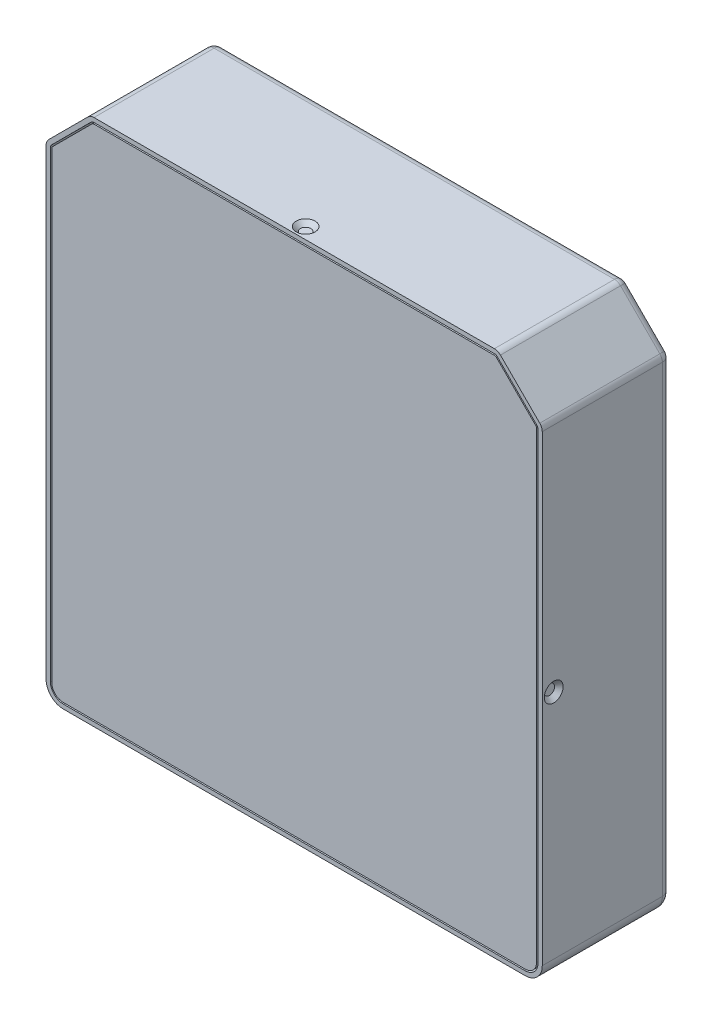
ISO-10303-21;
HEADER;
FILE_DESCRIPTION(('STEP AP214'),'2;1');
FILE_NAME('part.step','',(''),(''),'','','');
FILE_SCHEMA(('AUTOMOTIVE_DESIGN { 1 0 10303 214 1 1 1 1 }'));
ENDSEC;
DATA;
#1=APPLICATION_CONTEXT('core data for automotive mechanical design processes');
#2=APPLICATION_PROTOCOL_DEFINITION('international standard','automotive_design',2000,#1);
#3=PRODUCT_CONTEXT('',#1,'mechanical');
#4=PRODUCT('Part','Part','',(#3));
#5=PRODUCT_RELATED_PRODUCT_CATEGORY('part','',(#4));
#6=PRODUCT_DEFINITION_FORMATION('','',#4);
#7=PRODUCT_DEFINITION_CONTEXT('part definition',#1,'design');
#8=PRODUCT_DEFINITION('design','',#6,#7);
#9=PRODUCT_DEFINITION_SHAPE('','',#8);
#10=(LENGTH_UNIT() NAMED_UNIT(*) SI_UNIT(.MILLI.,.METRE.));
#11=(NAMED_UNIT(*) PLANE_ANGLE_UNIT() SI_UNIT($,.RADIAN.));
#12=(NAMED_UNIT(*) SI_UNIT($,.STERADIAN.) SOLID_ANGLE_UNIT());
#13=UNCERTAINTY_MEASURE_WITH_UNIT(LENGTH_MEASURE(1.E-05),#10,'distance_accuracy_value','');
#14=(GEOMETRIC_REPRESENTATION_CONTEXT(3) GLOBAL_UNCERTAINTY_ASSIGNED_CONTEXT((#13)) GLOBAL_UNIT_ASSIGNED_CONTEXT((#10,
#11,#12)) REPRESENTATION_CONTEXT('',''));
#15=CARTESIAN_POINT('',(0.,0.,0.));
#16=DIRECTION('',(0.,0.,1.));
#17=DIRECTION('',(1.,0.,0.));
#18=AXIS2_PLACEMENT_3D('',#15,#16,#17);
#19=CARTESIAN_POINT('',(-80.7500000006,6.00000000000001,33.));
#20=DIRECTION('',(0.,0.,1.));
#21=DIRECTION('',(1.,0.,0.));
#22=AXIS2_PLACEMENT_3D('',#19,#20,#21);
#23=CYLINDRICAL_SURFACE('',#22,4.);
#24=CARTESIAN_POINT('',(-80.7500000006,6.00000000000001,45.));
#25=DIRECTION('',(0.,0.,1.));
#26=DIRECTION('',(1.,0.,0.));
#27=AXIS2_PLACEMENT_3D('',#24,#25,#26);
#28=CIRCLE('',#27,4.);
#29=CARTESIAN_POINT('',(-84.7500000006,6.00000000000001,45.));
#30=VERTEX_POINT('',#29);
#31=CARTESIAN_POINT('',(-80.7499999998,2.00000000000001,45.));
#32=VERTEX_POINT('',#31);
#33=EDGE_CURVE('E166',#30,#32,#28,.T.);
#34=ORIENTED_EDGE('',*,*,#33,.F.);
#35=DIRECTION('',(0.,0.,1.));
#36=VECTOR('',#35,1.);
#37=CARTESIAN_POINT('',(-84.7500000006,6.00000000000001,33.));
#38=LINE('',#37,#36);
#39=CARTESIAN_POINT('',(-84.7500000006,6.00000000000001,33.));
#40=VERTEX_POINT('',#39);
#41=EDGE_CURVE('E12',#40,#30,#38,.T.);
#42=ORIENTED_EDGE('',*,*,#41,.F.);
#43=CARTESIAN_POINT('',(-80.7500000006,6.00000000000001,33.));
#44=DIRECTION('',(0.,0.,1.));
#45=DIRECTION('',(1.,0.,0.));
#46=AXIS2_PLACEMENT_3D('',#43,#44,#45);
#47=CIRCLE('',#46,4.);
#48=CARTESIAN_POINT('',(-80.7499999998,2.00000000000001,33.));
#49=VERTEX_POINT('',#48);
#50=EDGE_CURVE('E198',#40,#49,#47,.T.);
#51=ORIENTED_EDGE('',*,*,#50,.T.);
#52=DIRECTION('',(0.,0.,1.));
#53=VECTOR('',#52,1.);
#54=CARTESIAN_POINT('',(-80.7499999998,2.00000000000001,33.));
#55=LINE('',#54,#53);
#56=EDGE_CURVE('E48',#49,#32,#55,.T.);
#57=ORIENTED_EDGE('',*,*,#56,.T.);
#58=EDGE_LOOP('',(#34,#42,#51,#57));
#59=FACE_BOUND('',#58,.T.);
#60=ADVANCED_FACE('F45',(#59),#23,.T.);
#61=CARTESIAN_POINT('',(-84.7500000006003,167.75735931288,33.));
#62=DIRECTION('',(-1.,0.,0.));
#63=DIRECTION('',(0.,-1.,0.));
#64=AXIS2_PLACEMENT_3D('',#61,#62,#63);
#65=PLANE('',#64);
#66=DIRECTION('',(0.,-1.,0.));
#67=VECTOR('',#66,1.);
#68=CARTESIAN_POINT('',(-84.7500000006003,167.75735931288,45.));
#69=LINE('',#68,#67);
#70=CARTESIAN_POINT('',(-84.7500000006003,167.75735931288,45.));
#71=VERTEX_POINT('',#70);
#72=EDGE_CURVE('E196',#71,#30,#69,.T.);
#73=ORIENTED_EDGE('',*,*,#72,.F.);
#74=DIRECTION('',(0.,0.,1.));
#75=VECTOR('',#74,1.);
#76=CARTESIAN_POINT('',(-84.7500000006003,167.75735931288,33.));
#77=LINE('',#76,#75);
#78=CARTESIAN_POINT('',(-84.7500000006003,167.75735931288,33.));
#79=VERTEX_POINT('',#78);
#80=EDGE_CURVE('E54',#79,#71,#77,.T.);
#81=ORIENTED_EDGE('',*,*,#80,.F.);
#82=DIRECTION('',(0.,-1.,0.));
#83=VECTOR('',#82,1.);
#84=CARTESIAN_POINT('',(-84.7500000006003,167.75735931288,33.));
#85=LINE('',#84,#83);
#86=EDGE_CURVE('E156',#79,#40,#85,.T.);
#87=ORIENTED_EDGE('',*,*,#86,.T.);
#88=ORIENTED_EDGE('',*,*,#41,.T.);
#89=EDGE_LOOP('',(#73,#81,#87,#88));
#90=FACE_BOUND('',#89,.T.);
#91=ADVANCED_FACE('F218',(#90),#65,.T.);
#92=CARTESIAN_POINT('',(-83.7500000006,167.75735931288,33.));
#93=DIRECTION('',(0.,0.,1.));
#94=DIRECTION('',(1.,0.,0.));
#95=AXIS2_PLACEMENT_3D('',#92,#93,#94);
#96=CYLINDRICAL_SURFACE('',#95,1.00000000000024);
#97=CARTESIAN_POINT('',(-83.7500000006,167.75735931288,45.));
#98=DIRECTION('',(0.,0.,1.));
#99=DIRECTION('',(1.,0.,0.));
#100=AXIS2_PLACEMENT_3D('',#97,#98,#99);
#101=CIRCLE('',#100,1.00000000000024);
#102=CARTESIAN_POINT('',(-84.4571067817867,168.464466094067,45.));
#103=VERTEX_POINT('',#102);
#104=EDGE_CURVE('E143',#103,#71,#101,.T.);
#105=ORIENTED_EDGE('',*,*,#104,.F.);
#106=DIRECTION('',(0.,0.,1.));
#107=VECTOR('',#106,1.);
#108=CARTESIAN_POINT('',(-84.4571067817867,168.464466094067,33.));
#109=LINE('',#108,#107);
#110=CARTESIAN_POINT('',(-84.4571067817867,168.464466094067,33.));
#111=VERTEX_POINT('',#110);
#112=EDGE_CURVE('E138',#111,#103,#109,.T.);
#113=ORIENTED_EDGE('',*,*,#112,.F.);
#114=CARTESIAN_POINT('',(-83.7500000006,167.75735931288,33.));
#115=DIRECTION('',(0.,0.,1.));
#116=DIRECTION('',(1.,0.,0.));
#117=AXIS2_PLACEMENT_3D('',#114,#115,#116);
#118=CIRCLE('',#117,1.00000000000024);
#119=EDGE_CURVE('E141',#111,#79,#118,.T.);
#120=ORIENTED_EDGE('',*,*,#119,.T.);
#121=ORIENTED_EDGE('',*,*,#80,.T.);
#122=EDGE_LOOP('',(#105,#113,#120,#121));
#123=FACE_BOUND('',#122,.T.);
#124=ADVANCED_FACE('F140',(#123),#96,.T.);
#125=CARTESIAN_POINT('',(-70.7144660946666,182.207106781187,33.));
#126=DIRECTION('',(-0.70710678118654,0.707106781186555,0.));
#127=DIRECTION('',(-0.707106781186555,-0.70710678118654,0.));
#128=AXIS2_PLACEMENT_3D('',#125,#126,#127);
#129=PLANE('',#128);
#130=DIRECTION('',(-0.707106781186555,-0.70710678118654,0.));
#131=VECTOR('',#130,1.);
#132=CARTESIAN_POINT('',(-70.7144660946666,182.207106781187,45.));
#133=LINE('',#132,#131);
#134=CARTESIAN_POINT('',(-70.7144660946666,182.207106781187,45.));
#135=VERTEX_POINT('',#134);
#136=EDGE_CURVE('E193',#135,#103,#133,.T.);
#137=ORIENTED_EDGE('',*,*,#136,.F.);
#138=DIRECTION('',(0.,0.,1.));
#139=VECTOR('',#138,1.);
#140=CARTESIAN_POINT('',(-70.7144660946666,182.207106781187,33.));
#141=LINE('',#140,#139);
#142=CARTESIAN_POINT('',(-70.7144660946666,182.207106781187,33.));
#143=VERTEX_POINT('',#142);
#144=EDGE_CURVE('E148',#143,#135,#141,.T.);
#145=ORIENTED_EDGE('',*,*,#144,.F.);
#146=DIRECTION('',(-0.707106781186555,-0.70710678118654,0.));
#147=VECTOR('',#146,1.);
#148=CARTESIAN_POINT('',(-70.7144660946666,182.207106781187,33.));
#149=LINE('',#148,#147);
#150=EDGE_CURVE('E154',#143,#111,#149,.T.);
#151=ORIENTED_EDGE('',*,*,#150,.T.);
#152=ORIENTED_EDGE('',*,*,#112,.T.);
#153=EDGE_LOOP('',(#137,#145,#151,#152));
#154=FACE_BOUND('',#153,.T.);
#155=ADVANCED_FACE('F158',(#154),#129,.T.);
#156=CARTESIAN_POINT('',(-70.00735931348,181.5,33.));
#157=DIRECTION('',(0.,0.,1.));
#158=DIRECTION('',(1.,0.,0.));
#159=AXIS2_PLACEMENT_3D('',#156,#157,#158);
#160=CYLINDRICAL_SURFACE('',#159,1.00000000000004);
#161=CARTESIAN_POINT('',(-70.00735931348,181.5,45.));
#162=DIRECTION('',(0.,0.,1.));
#163=DIRECTION('',(1.,0.,0.));
#164=AXIS2_PLACEMENT_3D('',#161,#162,#163);
#165=CIRCLE('',#164,1.00000000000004);
#166=CARTESIAN_POINT('',(-70.00735931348,182.5,45.));
#167=VERTEX_POINT('',#166);
#168=EDGE_CURVE('E190',#167,#135,#165,.T.);
#169=ORIENTED_EDGE('',*,*,#168,.F.);
#170=DIRECTION('',(0.,0.,1.));
#171=VECTOR('',#170,1.);
#172=CARTESIAN_POINT('',(-70.00735931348,182.5,33.));
#173=LINE('',#172,#171);
#174=CARTESIAN_POINT('',(-70.00735931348,182.5,33.));
#175=VERTEX_POINT('',#174);
#176=EDGE_CURVE('E202',#175,#167,#173,.T.);
#177=ORIENTED_EDGE('',*,*,#176,.F.);
#178=CARTESIAN_POINT('',(-70.00735931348,181.5,33.));
#179=DIRECTION('',(0.,0.,1.));
#180=DIRECTION('',(1.,0.,0.));
#181=AXIS2_PLACEMENT_3D('',#178,#179,#180);
#182=CIRCLE('',#181,1.00000000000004);
#183=EDGE_CURVE('E159',#175,#143,#182,.T.);
#184=ORIENTED_EDGE('',*,*,#183,.T.);
#185=ORIENTED_EDGE('',*,*,#144,.T.);
#186=EDGE_LOOP('',(#169,#177,#184,#185));
#187=FACE_BOUND('',#186,.T.);
#188=ADVANCED_FACE('F231',(#187),#160,.T.);
#189=CARTESIAN_POINT('',(70.00735931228,182.5,33.));
#190=DIRECTION('',(0.,1.,0.));
#191=DIRECTION('',(-1.,0.,0.));
#192=AXIS2_PLACEMENT_3D('',#189,#190,#191);
#193=PLANE('',#192);
#194=DIRECTION('',(-1.,0.,0.));
#195=VECTOR('',#194,1.);
#196=CARTESIAN_POINT('',(70.00735931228,182.5,45.));
#197=LINE('',#196,#195);
#198=CARTESIAN_POINT('',(70.00735931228,182.5,45.));
#199=VERTEX_POINT('',#198);
#200=EDGE_CURVE('E187',#199,#167,#197,.T.);
#201=ORIENTED_EDGE('',*,*,#200,.F.);
#202=DIRECTION('',(0.,0.,1.));
#203=VECTOR('',#202,1.);
#204=CARTESIAN_POINT('',(70.00735931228,182.5,33.));
#205=LINE('',#204,#203);
#206=CARTESIAN_POINT('',(70.00735931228,182.5,33.));
#207=VERTEX_POINT('',#206);
#208=EDGE_CURVE('E204',#207,#199,#205,.T.);
#209=ORIENTED_EDGE('',*,*,#208,.F.);
#210=DIRECTION('',(-1.,0.,0.));
#211=VECTOR('',#210,1.);
#212=CARTESIAN_POINT('',(70.00735931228,182.5,33.));
#213=LINE('',#212,#211);
#214=EDGE_CURVE('E161',#207,#175,#213,.T.);
#215=ORIENTED_EDGE('',*,*,#214,.T.);
#216=ORIENTED_EDGE('',*,*,#176,.T.);
#217=EDGE_LOOP('',(#201,#209,#215,#216));
#218=FACE_BOUND('',#217,.T.);
#219=ADVANCED_FACE('F234',(#218),#193,.T.);
#220=CARTESIAN_POINT('',(70.00735931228,181.5,33.));
#221=DIRECTION('',(0.,0.,1.));
#222=DIRECTION('',(1.,0.,0.));
#223=AXIS2_PLACEMENT_3D('',#220,#221,#222);
#224=CYLINDRICAL_SURFACE('',#223,1.00000000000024);
#225=CARTESIAN_POINT('',(70.00735931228,181.5,45.));
#226=DIRECTION('',(0.,0.,1.));
#227=DIRECTION('',(1.,0.,0.));
#228=AXIS2_PLACEMENT_3D('',#225,#226,#227);
#229=CIRCLE('',#228,1.00000000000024);
#230=CARTESIAN_POINT('',(70.7144660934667,182.207106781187,45.));
#231=VERTEX_POINT('',#230);
#232=EDGE_CURVE('E184',#231,#199,#229,.T.);
#233=ORIENTED_EDGE('',*,*,#232,.F.);
#234=DIRECTION('',(0.,0.,1.));
#235=VECTOR('',#234,1.);
#236=CARTESIAN_POINT('',(70.7144660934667,182.207106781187,33.));
#237=LINE('',#236,#235);
#238=CARTESIAN_POINT('',(70.7144660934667,182.207106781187,33.));
#239=VERTEX_POINT('',#238);
#240=EDGE_CURVE('E206',#239,#231,#237,.T.);
#241=ORIENTED_EDGE('',*,*,#240,.F.);
#242=CARTESIAN_POINT('',(70.00735931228,181.5,33.));
#243=DIRECTION('',(0.,0.,1.));
#244=DIRECTION('',(1.,0.,0.));
#245=AXIS2_PLACEMENT_3D('',#242,#243,#244);
#246=CIRCLE('',#245,1.00000000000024);
#247=EDGE_CURVE('E360',#239,#207,#246,.T.);
#248=ORIENTED_EDGE('',*,*,#247,.T.);
#249=ORIENTED_EDGE('',*,*,#208,.T.);
#250=EDGE_LOOP('',(#233,#241,#248,#249));
#251=FACE_BOUND('',#250,.T.);
#252=ADVANCED_FACE('F238',(#251),#224,.T.);
#253=CARTESIAN_POINT('',(84.4571067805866,168.464466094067,33.));
#254=DIRECTION('',(0.707106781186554,0.707106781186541,0.));
#255=DIRECTION('',(-0.707106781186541,0.707106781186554,0.));
#256=AXIS2_PLACEMENT_3D('',#253,#254,#255);
#257=PLANE('',#256);
#258=DIRECTION('',(-0.707106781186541,0.707106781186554,0.));
#259=VECTOR('',#258,1.);
#260=CARTESIAN_POINT('',(84.4571067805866,168.464466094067,45.));
#261=LINE('',#260,#259);
#262=CARTESIAN_POINT('',(84.4571067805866,168.464466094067,45.));
#263=VERTEX_POINT('',#262);
#264=EDGE_CURVE('E181',#263,#231,#261,.T.);
#265=ORIENTED_EDGE('',*,*,#264,.F.);
#266=DIRECTION('',(0.,0.,1.));
#267=VECTOR('',#266,1.);
#268=CARTESIAN_POINT('',(84.4571067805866,168.464466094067,33.));
#269=LINE('',#268,#267);
#270=CARTESIAN_POINT('',(84.4571067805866,168.464466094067,33.));
#271=VERTEX_POINT('',#270);
#272=EDGE_CURVE('E208',#271,#263,#269,.T.);
#273=ORIENTED_EDGE('',*,*,#272,.F.);
#274=DIRECTION('',(-0.707106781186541,0.707106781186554,0.));
#275=VECTOR('',#274,1.);
#276=CARTESIAN_POINT('',(84.4571067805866,168.464466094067,33.));
#277=LINE('',#276,#275);
#278=EDGE_CURVE('E364',#271,#239,#277,.T.);
#279=ORIENTED_EDGE('',*,*,#278,.T.);
#280=ORIENTED_EDGE('',*,*,#240,.T.);
#281=EDGE_LOOP('',(#265,#273,#279,#280));
#282=FACE_BOUND('',#281,.T.);
#283=ADVANCED_FACE('F242',(#282),#257,.T.);
#284=CARTESIAN_POINT('',(83.7499999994,167.75735931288,33.));
#285=DIRECTION('',(0.,0.,1.));
#286=DIRECTION('',(1.,0.,0.));
#287=AXIS2_PLACEMENT_3D('',#284,#285,#286);
#288=CYLINDRICAL_SURFACE('',#287,1.00000000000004);
#289=CARTESIAN_POINT('',(83.7499999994,167.75735931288,45.));
#290=DIRECTION('',(0.,0.,1.));
#291=DIRECTION('',(1.,0.,0.));
#292=AXIS2_PLACEMENT_3D('',#289,#290,#291);
#293=CIRCLE('',#292,1.00000000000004);
#294=CARTESIAN_POINT('',(84.7499999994,167.75735931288,45.));
#295=VERTEX_POINT('',#294);
#296=EDGE_CURVE('E178',#295,#263,#293,.T.);
#297=ORIENTED_EDGE('',*,*,#296,.F.);
#298=DIRECTION('',(0.,0.,1.));
#299=VECTOR('',#298,1.);
#300=CARTESIAN_POINT('',(84.7499999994,167.75735931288,33.));
#301=LINE('',#300,#299);
#302=CARTESIAN_POINT('',(84.7499999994,167.75735931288,33.));
#303=VERTEX_POINT('',#302);
#304=EDGE_CURVE('E210',#303,#295,#301,.T.);
#305=ORIENTED_EDGE('',*,*,#304,.F.);
#306=CARTESIAN_POINT('',(83.7499999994,167.75735931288,33.));
#307=DIRECTION('',(0.,0.,1.));
#308=DIRECTION('',(1.,0.,0.));
#309=AXIS2_PLACEMENT_3D('',#306,#307,#308);
#310=CIRCLE('',#309,1.00000000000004);
#311=EDGE_CURVE('E353',#303,#271,#310,.T.);
#312=ORIENTED_EDGE('',*,*,#311,.T.);
#313=ORIENTED_EDGE('',*,*,#272,.T.);
#314=EDGE_LOOP('',(#297,#305,#312,#313));
#315=FACE_BOUND('',#314,.T.);
#316=ADVANCED_FACE('F246',(#315),#288,.T.);
#317=CARTESIAN_POINT('',(84.7499999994,6.00000000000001,33.));
#318=DIRECTION('',(1.,0.,0.));
#319=DIRECTION('',(0.,0.,-1.));
#320=AXIS2_PLACEMENT_3D('',#317,#318,#319);
#321=PLANE('',#320);
#322=DIRECTION('',(0.,1.,0.));
#323=VECTOR('',#322,1.);
#324=CARTESIAN_POINT('',(84.7499999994,6.00000000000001,45.));
#325=LINE('',#324,#323);
#326=CARTESIAN_POINT('',(84.7499999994,6.00000000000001,45.));
#327=VERTEX_POINT('',#326);
#328=EDGE_CURVE('E175',#327,#295,#325,.T.);
#329=ORIENTED_EDGE('',*,*,#328,.F.);
#330=DIRECTION('',(0.,0.,1.));
#331=VECTOR('',#330,1.);
#332=CARTESIAN_POINT('',(84.7499999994,6.00000000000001,33.));
#333=LINE('',#332,#331);
#334=CARTESIAN_POINT('',(84.7499999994,6.00000000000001,33.));
#335=VERTEX_POINT('',#334);
#336=EDGE_CURVE('E212',#335,#327,#333,.T.);
#337=ORIENTED_EDGE('',*,*,#336,.F.);
#338=DIRECTION('',(0.,1.,0.));
#339=VECTOR('',#338,1.);
#340=CARTESIAN_POINT('',(84.7499999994,6.00000000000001,33.));
#341=LINE('',#340,#339);
#342=EDGE_CURVE('E349',#335,#303,#341,.T.);
#343=ORIENTED_EDGE('',*,*,#342,.T.);
#344=ORIENTED_EDGE('',*,*,#304,.T.);
#345=EDGE_LOOP('',(#329,#337,#343,#344));
#346=FACE_BOUND('',#345,.T.);
#347=ADVANCED_FACE('F250',(#346),#321,.T.);
#348=CARTESIAN_POINT('',(80.7499999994,6.00000000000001,33.));
#349=DIRECTION('',(0.,0.,1.));
#350=DIRECTION('',(1.,0.,0.));
#351=AXIS2_PLACEMENT_3D('',#348,#349,#350);
#352=CYLINDRICAL_SURFACE('',#351,4.);
#353=CARTESIAN_POINT('',(80.7499999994,6.00000000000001,45.));
#354=DIRECTION('',(0.,0.,1.));
#355=DIRECTION('',(1.,0.,0.));
#356=AXIS2_PLACEMENT_3D('',#353,#354,#355);
#357=CIRCLE('',#356,4.);
#358=CARTESIAN_POINT('',(80.7499999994,2.00000000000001,45.));
#359=VERTEX_POINT('',#358);
#360=EDGE_CURVE('E172',#359,#327,#357,.T.);
#361=ORIENTED_EDGE('',*,*,#360,.F.);
#362=DIRECTION('',(0.,0.,1.));
#363=VECTOR('',#362,1.);
#364=CARTESIAN_POINT('',(80.7499999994,2.00000000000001,33.));
#365=LINE('',#364,#363);
#366=CARTESIAN_POINT('',(80.7499999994,2.00000000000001,33.));
#367=VERTEX_POINT('',#366);
#368=EDGE_CURVE('E213',#367,#359,#365,.T.);
#369=ORIENTED_EDGE('',*,*,#368,.F.);
#370=CARTESIAN_POINT('',(80.7499999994,6.00000000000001,33.));
#371=DIRECTION('',(0.,0.,1.));
#372=DIRECTION('',(1.,0.,0.));
#373=AXIS2_PLACEMENT_3D('',#370,#371,#372);
#374=CIRCLE('',#373,4.);
#375=EDGE_CURVE('E370',#367,#335,#374,.T.);
#376=ORIENTED_EDGE('',*,*,#375,.T.);
#377=ORIENTED_EDGE('',*,*,#336,.T.);
#378=EDGE_LOOP('',(#361,#369,#376,#377));
#379=FACE_BOUND('',#378,.T.);
#380=ADVANCED_FACE('F254',(#379),#352,.T.);
#381=CARTESIAN_POINT('',(-80.7499999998,2.00000000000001,33.));
#382=DIRECTION('',(0.,-1.,0.));
#383=DIRECTION('',(1.,0.,0.));
#384=AXIS2_PLACEMENT_3D('',#381,#382,#383);
#385=PLANE('',#384);
#386=DIRECTION('',(1.,0.,0.));
#387=VECTOR('',#386,1.);
#388=CARTESIAN_POINT('',(-80.7499999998,2.00000000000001,45.));
#389=LINE('',#388,#387);
#390=EDGE_CURVE('E169',#32,#359,#389,.T.);
#391=ORIENTED_EDGE('',*,*,#390,.F.);
#392=ORIENTED_EDGE('',*,*,#56,.F.);
#393=DIRECTION('',(1.,0.,0.));
#394=VECTOR('',#393,1.);
#395=CARTESIAN_POINT('',(-80.7499999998,2.00000000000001,33.));
#396=LINE('',#395,#394);
#397=EDGE_CURVE('E372',#49,#367,#396,.T.);
#398=ORIENTED_EDGE('',*,*,#397,.T.);
#399=ORIENTED_EDGE('',*,*,#368,.T.);
#400=EDGE_LOOP('',(#391,#392,#398,#399));
#401=FACE_BOUND('',#400,.T.);
#402=ADVANCED_FACE('F215',(#401),#385,.T.);
#403=CARTESIAN_POINT('',(-80.7500000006,6.00000000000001,33.));
#404=DIRECTION('',(0.,0.,1.));
#405=DIRECTION('',(1.,0.,0.));
#406=AXIS2_PLACEMENT_3D('',#403,#404,#405);
#407=PLANE('',#406);
#408=ORIENTED_EDGE('',*,*,#50,.F.);
#409=ORIENTED_EDGE('',*,*,#86,.F.);
#410=ORIENTED_EDGE('',*,*,#119,.F.);
#411=ORIENTED_EDGE('',*,*,#150,.F.);
#412=ORIENTED_EDGE('',*,*,#183,.F.);
#413=ORIENTED_EDGE('',*,*,#214,.F.);
#414=ORIENTED_EDGE('',*,*,#247,.F.);
#415=ORIENTED_EDGE('',*,*,#278,.F.);
#416=ORIENTED_EDGE('',*,*,#311,.F.);
#417=ORIENTED_EDGE('',*,*,#342,.F.);
#418=ORIENTED_EDGE('',*,*,#375,.F.);
#419=ORIENTED_EDGE('',*,*,#397,.F.);
#420=EDGE_LOOP('',(#408,#409,#410,#411,#412,#413,#414,#415,#416,#417,#418,#419));
#421=FACE_BOUND('',#420,.T.);
#422=ADVANCED_FACE('F152',(#421),#407,.F.);
#423=CARTESIAN_POINT('',(-80.7500000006,6.00000000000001,45.));
#424=DIRECTION('',(0.,0.,1.));
#425=DIRECTION('',(1.,0.,0.));
#426=AXIS2_PLACEMENT_3D('',#423,#424,#425);
#427=PLANE('',#426);
#428=ORIENTED_EDGE('',*,*,#33,.T.);
#429=ORIENTED_EDGE('',*,*,#390,.T.);
#430=ORIENTED_EDGE('',*,*,#360,.T.);
#431=ORIENTED_EDGE('',*,*,#328,.T.);
#432=ORIENTED_EDGE('',*,*,#296,.T.);
#433=ORIENTED_EDGE('',*,*,#264,.T.);
#434=ORIENTED_EDGE('',*,*,#232,.T.);
#435=ORIENTED_EDGE('',*,*,#200,.T.);
#436=ORIENTED_EDGE('',*,*,#168,.T.);
#437=ORIENTED_EDGE('',*,*,#136,.T.);
#438=ORIENTED_EDGE('',*,*,#104,.T.);
#439=ORIENTED_EDGE('',*,*,#72,.T.);
#440=EDGE_LOOP('',(#428,#429,#430,#431,#432,#433,#434,#435,#436,#437,#438,#439));
#441=FACE_BOUND('',#440,.T.);
#442=ADVANCED_FACE('F217',(#441),#427,.T.);
#443=CLOSED_SHELL('',(#60,#91,#124,#155,#188,#219,#252,#283,#316,#347,#380,#402,#422,#442));
#444=MANIFOLD_SOLID_BREP('B2',#443);
#445=CARTESIAN_POINT('',(-80.7500000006,6.00000000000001,45.));
#446=DIRECTION('',(0.,0.,-1.));
#447=DIRECTION('',(-1.,0.,0.));
#448=AXIS2_PLACEMENT_3D('',#445,#446,#447);
#449=CYLINDRICAL_SURFACE('',#448,6.);
#450=DIRECTION('',(0.,0.,-1.));
#451=VECTOR('',#450,1.);
#452=CARTESIAN_POINT('',(-86.7500000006,6.00000000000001,45.));
#453=LINE('',#452,#451);
#454=CARTESIAN_POINT('',(-86.7500000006,6.00000000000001,45.));
#455=VERTEX_POINT('',#454);
#456=CARTESIAN_POINT('',(-86.7500000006,6.00000000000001,3.));
#457=VERTEX_POINT('',#456);
#458=EDGE_CURVE('E765',#455,#457,#453,.T.);
#459=ORIENTED_EDGE('',*,*,#458,.T.);
#460=CARTESIAN_POINT('',(-80.7500000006,6.00000000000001,2.99999999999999));
#461=DIRECTION('',(0.,0.,1.));
#462=DIRECTION('',(1.,0.,0.));
#463=AXIS2_PLACEMENT_3D('',#460,#461,#462);
#464=CIRCLE('',#463,6.);
#465=CARTESIAN_POINT('',(-80.7499999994,0.,3.));
#466=VERTEX_POINT('',#465);
#467=EDGE_CURVE('E43',#457,#466,#464,.T.);
#468=ORIENTED_EDGE('',*,*,#467,.T.);
#469=DIRECTION('',(0.,0.,-1.));
#470=VECTOR('',#469,1.);
#471=CARTESIAN_POINT('',(-80.7499999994,0.,45.));
#472=LINE('',#471,#470);
#473=CARTESIAN_POINT('',(-80.7499999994,0.,45.));
#474=VERTEX_POINT('',#473);
#475=EDGE_CURVE('E796',#474,#466,#472,.T.);
#476=ORIENTED_EDGE('',*,*,#475,.F.);
#477=CARTESIAN_POINT('',(-80.7500000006,6.00000000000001,45.));
#478=DIRECTION('',(0.,0.,1.));
#479=DIRECTION('',(1.,0.,0.));
#480=AXIS2_PLACEMENT_3D('',#477,#478,#479);
#481=CIRCLE('',#480,6.);
#482=EDGE_CURVE('E740',#455,#474,#481,.T.);
#483=ORIENTED_EDGE('',*,*,#482,.F.);
#484=EDGE_LOOP('',(#459,#468,#476,#483));
#485=FACE_BOUND('',#484,.T.);
#486=ADVANCED_FACE('F376',(#485),#449,.T.);
#487=CARTESIAN_POINT('',(-80.7499999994,0.,45.));
#488=DIRECTION('',(0.,1.,0.));
#489=DIRECTION('',(0.,0.,1.));
#490=AXIS2_PLACEMENT_3D('',#487,#488,#489);
#491=PLANE('',#490);
#492=CARTESIAN_POINT('',(-1.86049092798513E-13,0.,41.));
#493=DIRECTION('',(0.,-1.,0.));
#494=DIRECTION('',(0.,0.,-1.));
#495=AXIS2_PLACEMENT_3D('',#492,#493,#494);
#496=CIRCLE('',#495,3.3);
#497=CARTESIAN_POINT('',(-1.86049092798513E-13,0.,37.7));
#498=VERTEX_POINT('',#497);
#499=EDGE_CURVE('E1442',#498,#498,#496,.T.);
#500=ORIENTED_EDGE('',*,*,#499,.F.);
#501=EDGE_LOOP('',(#500));
#502=FACE_BOUND('',#501,.T.);
#503=ORIENTED_EDGE('',*,*,#475,.T.);
#504=DIRECTION('',(1.,0.,0.));
#505=VECTOR('',#504,1.);
#506=CARTESIAN_POINT('',(-80.7499999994,0.,3.));
#507=LINE('',#506,#505);
#508=CARTESIAN_POINT('',(80.7499999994,0.,3.));
#509=VERTEX_POINT('',#508);
#510=EDGE_CURVE('E799',#466,#509,#507,.T.);
#511=ORIENTED_EDGE('',*,*,#510,.T.);
#512=DIRECTION('',(0.,0.,-1.));
#513=VECTOR('',#512,1.);
#514=CARTESIAN_POINT('',(80.7499999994,0.,45.));
#515=LINE('',#514,#513);
#516=CARTESIAN_POINT('',(80.7499999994,0.,45.));
#517=VERTEX_POINT('',#516);
#518=EDGE_CURVE('E793',#517,#509,#515,.T.);
#519=ORIENTED_EDGE('',*,*,#518,.F.);
#520=DIRECTION('',(1.,0.,0.));
#521=VECTOR('',#520,1.);
#522=CARTESIAN_POINT('',(-80.7499999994,0.,45.));
#523=LINE('',#522,#521);
#524=EDGE_CURVE('E743',#474,#517,#523,.T.);
#525=ORIENTED_EDGE('',*,*,#524,.F.);
#526=EDGE_LOOP('',(#503,#511,#519,#525));
#527=FACE_BOUND('',#526,.T.);
#528=ADVANCED_FACE('F931',(#502,#527),#491,.F.);
#529=CARTESIAN_POINT('',(80.7499999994,6.00000000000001,45.));
#530=DIRECTION('',(0.,0.,-1.));
#531=DIRECTION('',(-1.,0.,0.));
#532=AXIS2_PLACEMENT_3D('',#529,#530,#531);
#533=CYLINDRICAL_SURFACE('',#532,6.);
#534=ORIENTED_EDGE('',*,*,#518,.T.);
#535=CARTESIAN_POINT('',(80.7499999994,6.00000000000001,2.99999999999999));
#536=DIRECTION('',(0.,0.,1.));
#537=DIRECTION('',(1.,0.,0.));
#538=AXIS2_PLACEMENT_3D('',#535,#536,#537);
#539=CIRCLE('',#538,6.);
#540=CARTESIAN_POINT('',(86.7499999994,6.00000000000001,3.00000000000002));
#541=VERTEX_POINT('',#540);
#542=EDGE_CURVE('E819',#509,#541,#539,.T.);
#543=ORIENTED_EDGE('',*,*,#542,.T.);
#544=DIRECTION('',(0.,0.,-1.));
#545=VECTOR('',#544,1.);
#546=CARTESIAN_POINT('',(86.7499999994,6.00000000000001,45.));
#547=LINE('',#546,#545);
#548=CARTESIAN_POINT('',(86.7499999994,6.00000000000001,45.));
#549=VERTEX_POINT('',#548);
#550=EDGE_CURVE('E790',#549,#541,#547,.T.);
#551=ORIENTED_EDGE('',*,*,#550,.F.);
#552=CARTESIAN_POINT('',(80.7499999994,6.00000000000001,45.));
#553=DIRECTION('',(0.,0.,1.));
#554=DIRECTION('',(1.,0.,0.));
#555=AXIS2_PLACEMENT_3D('',#552,#553,#554);
#556=CIRCLE('',#555,6.);
#557=EDGE_CURVE('E745',#517,#549,#556,.T.);
#558=ORIENTED_EDGE('',*,*,#557,.F.);
#559=EDGE_LOOP('',(#534,#543,#551,#558));
#560=FACE_BOUND('',#559,.T.);
#561=ADVANCED_FACE('F938',(#560),#533,.T.);
#562=CARTESIAN_POINT('',(86.7499999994,6.00000000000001,45.));
#563=DIRECTION('',(-1.,0.,0.));
#564=DIRECTION('',(0.,0.,1.));
#565=AXIS2_PLACEMENT_3D('',#562,#563,#564);
#566=PLANE('',#565);
#567=CARTESIAN_POINT('',(86.7500000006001,86.87867965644,41.));
#568=DIRECTION('',(1.,0.,0.));
#569=DIRECTION('',(0.,0.,-1.));
#570=AXIS2_PLACEMENT_3D('',#567,#568,#569);
#571=CIRCLE('',#570,3.3);
#572=CARTESIAN_POINT('',(86.7500000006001,86.87867965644,37.7));
#573=VERTEX_POINT('',#572);
#574=EDGE_CURVE('E1429',#573,#573,#571,.T.);
#575=ORIENTED_EDGE('',*,*,#574,.F.);
#576=EDGE_LOOP('',(#575));
#577=FACE_BOUND('',#576,.T.);
#578=ORIENTED_EDGE('',*,*,#550,.T.);
#579=DIRECTION('',(0.,1.,0.));
#580=VECTOR('',#579,1.);
#581=CARTESIAN_POINT('',(86.7499999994,6.00000000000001,3.));
#582=LINE('',#581,#580);
#583=CARTESIAN_POINT('',(86.7499999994,167.75735931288,3.00000000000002));
#584=VERTEX_POINT('',#583);
#585=EDGE_CURVE('E821',#541,#584,#582,.T.);
#586=ORIENTED_EDGE('',*,*,#585,.T.);
#587=DIRECTION('',(0.,0.,-1.));
#588=VECTOR('',#587,1.);
#589=CARTESIAN_POINT('',(86.7499999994,167.75735931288,45.));
#590=LINE('',#589,#588);
#591=CARTESIAN_POINT('',(86.7499999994,167.75735931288,45.));
#592=VERTEX_POINT('',#591);
#593=EDGE_CURVE('E787',#592,#584,#590,.T.);
#594=ORIENTED_EDGE('',*,*,#593,.F.);
#595=DIRECTION('',(0.,1.,0.));
#596=VECTOR('',#595,1.);
#597=CARTESIAN_POINT('',(86.7499999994,6.00000000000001,45.));
#598=LINE('',#597,#596);
#599=EDGE_CURVE('E747',#549,#592,#598,.T.);
#600=ORIENTED_EDGE('',*,*,#599,.F.);
#601=EDGE_LOOP('',(#578,#586,#594,#600));
#602=FACE_BOUND('',#601,.T.);
#603=ADVANCED_FACE('F942',(#577,#602),#566,.F.);
#604=CARTESIAN_POINT('',(83.7499999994,167.75735931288,45.));
#605=DIRECTION('',(0.,0.,-1.));
#606=DIRECTION('',(-1.,0.,0.));
#607=AXIS2_PLACEMENT_3D('',#604,#605,#606);
#608=CYLINDRICAL_SURFACE('',#607,3.00000000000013);
#609=ORIENTED_EDGE('',*,*,#593,.T.);
#610=CARTESIAN_POINT('',(83.7499999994,167.75735931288,3.00000000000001));
#611=DIRECTION('',(0.,0.,-1.));
#612=DIRECTION('',(-1.,0.,0.));
#613=AXIS2_PLACEMENT_3D('',#610,#611,#612);
#614=CIRCLE('',#613,3.00000000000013);
#615=CARTESIAN_POINT('',(85.8713203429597,169.87867965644,3.00000000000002));
#616=VERTEX_POINT('',#615);
#617=EDGE_CURVE('E823',#584,#616,#614,.F.);
#618=ORIENTED_EDGE('',*,*,#617,.T.);
#619=DIRECTION('',(0.,0.,-1.));
#620=VECTOR('',#619,1.);
#621=CARTESIAN_POINT('',(85.8713203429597,169.87867965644,45.));
#622=LINE('',#621,#620);
#623=CARTESIAN_POINT('',(85.8713203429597,169.87867965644,45.));
#624=VERTEX_POINT('',#623);
#625=EDGE_CURVE('E784',#624,#616,#622,.T.);
#626=ORIENTED_EDGE('',*,*,#625,.F.);
#627=CARTESIAN_POINT('',(83.7499999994,167.75735931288,45.));
#628=DIRECTION('',(0.,0.,1.));
#629=DIRECTION('',(1.,0.,0.));
#630=AXIS2_PLACEMENT_3D('',#627,#628,#629);
#631=CIRCLE('',#630,3.00000000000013);
#632=EDGE_CURVE('E749',#592,#624,#631,.T.);
#633=ORIENTED_EDGE('',*,*,#632,.F.);
#634=EDGE_LOOP('',(#609,#618,#626,#633));
#635=FACE_BOUND('',#634,.T.);
#636=ADVANCED_FACE('F947',(#635),#608,.T.);
#637=CARTESIAN_POINT('',(85.8713203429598,169.87867965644,45.));
#638=DIRECTION('',(-0.707106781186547,-0.707106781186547,0.));
#639=DIRECTION('',(0.707106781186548,-0.707106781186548,0.));
#640=AXIS2_PLACEMENT_3D('',#637,#638,#639);
#641=PLANE('',#640);
#642=ORIENTED_EDGE('',*,*,#625,.T.);
#643=DIRECTION('',(-0.707106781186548,0.707106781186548,0.));
#644=VECTOR('',#643,1.);
#645=CARTESIAN_POINT('',(85.8713203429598,169.87867965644,3.));
#646=LINE('',#645,#644);
#647=CARTESIAN_POINT('',(72.1286796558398,183.62132034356,3.00000000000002));
#648=VERTEX_POINT('',#647);
#649=EDGE_CURVE('E825',#616,#648,#646,.T.);
#650=ORIENTED_EDGE('',*,*,#649,.T.);
#651=DIRECTION('',(0.,0.,-1.));
#652=VECTOR('',#651,1.);
#653=CARTESIAN_POINT('',(72.1286796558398,183.62132034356,45.));
#654=LINE('',#653,#652);
#655=CARTESIAN_POINT('',(72.1286796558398,183.62132034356,45.));
#656=VERTEX_POINT('',#655);
#657=EDGE_CURVE('E781',#656,#648,#654,.T.);
#658=ORIENTED_EDGE('',*,*,#657,.F.);
#659=DIRECTION('',(-0.707106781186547,0.707106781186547,0.));
#660=VECTOR('',#659,1.);
#661=CARTESIAN_POINT('',(85.8713203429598,169.87867965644,45.));
#662=LINE('',#661,#660);
#663=EDGE_CURVE('E751',#624,#656,#662,.T.);
#664=ORIENTED_EDGE('',*,*,#663,.F.);
#665=EDGE_LOOP('',(#642,#650,#658,#664));
#666=FACE_BOUND('',#665,.T.);
#667=ADVANCED_FACE('F952',(#666),#641,.F.);
#668=CARTESIAN_POINT('',(70.00735931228,181.5,45.));
#669=DIRECTION('',(0.,0.,-1.));
#670=DIRECTION('',(-1.,0.,0.));
#671=AXIS2_PLACEMENT_3D('',#668,#669,#670);
#672=CYLINDRICAL_SURFACE('',#671,3.0000000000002);
#673=ORIENTED_EDGE('',*,*,#657,.T.);
#674=CARTESIAN_POINT('',(70.00735931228,181.5,3.00000000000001));
#675=DIRECTION('',(0.,0.,-1.));
#676=DIRECTION('',(-1.,0.,0.));
#677=AXIS2_PLACEMENT_3D('',#674,#675,#676);
#678=CIRCLE('',#677,3.0000000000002);
#679=CARTESIAN_POINT('',(70.00735931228,184.5,3.00000000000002));
#680=VERTEX_POINT('',#679);
#681=EDGE_CURVE('E827',#648,#680,#678,.F.);
#682=ORIENTED_EDGE('',*,*,#681,.T.);
#683=DIRECTION('',(0.,0.,-1.));
#684=VECTOR('',#683,1.);
#685=CARTESIAN_POINT('',(70.00735931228,184.5,45.));
#686=LINE('',#685,#684);
#687=CARTESIAN_POINT('',(70.00735931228,184.5,45.));
#688=VERTEX_POINT('',#687);
#689=EDGE_CURVE('E778',#688,#680,#686,.T.);
#690=ORIENTED_EDGE('',*,*,#689,.F.);
#691=CARTESIAN_POINT('',(70.00735931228,181.5,45.));
#692=DIRECTION('',(0.,0.,1.));
#693=DIRECTION('',(1.,0.,0.));
#694=AXIS2_PLACEMENT_3D('',#691,#692,#693);
#695=CIRCLE('',#694,3.0000000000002);
#696=EDGE_CURVE('E753',#656,#688,#695,.T.);
#697=ORIENTED_EDGE('',*,*,#696,.F.);
#698=EDGE_LOOP('',(#673,#682,#690,#697));
#699=FACE_BOUND('',#698,.T.);
#700=ADVANCED_FACE('F954',(#699),#672,.T.);
#701=CARTESIAN_POINT('',(70.00735931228,184.5,45.));
#702=DIRECTION('',(0.,-1.,0.));
#703=DIRECTION('',(1.,0.,0.));
#704=AXIS2_PLACEMENT_3D('',#701,#702,#703);
#705=PLANE('',#704);
#706=CARTESIAN_POINT('',(-1.82870192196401E-13,184.5,41.));
#707=DIRECTION('',(0.,1.,0.));
#708=DIRECTION('',(0.,0.,1.));
#709=AXIS2_PLACEMENT_3D('',#706,#707,#708);
#710=CIRCLE('',#709,3.3);
#711=CARTESIAN_POINT('',(-1.82870192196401E-13,184.5,44.3));
#712=VERTEX_POINT('',#711);
#713=EDGE_CURVE('E1436',#712,#712,#710,.T.);
#714=ORIENTED_EDGE('',*,*,#713,.F.);
#715=EDGE_LOOP('',(#714));
#716=FACE_BOUND('',#715,.T.);
#717=ORIENTED_EDGE('',*,*,#689,.T.);
#718=DIRECTION('',(-1.,0.,0.));
#719=VECTOR('',#718,1.);
#720=CARTESIAN_POINT('',(70.00735931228,184.5,3.));
#721=LINE('',#720,#719);
#722=CARTESIAN_POINT('',(-70.00735931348,184.5,3.00000000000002));
#723=VERTEX_POINT('',#722);
#724=EDGE_CURVE('E829',#680,#723,#721,.T.);
#725=ORIENTED_EDGE('',*,*,#724,.T.);
#726=DIRECTION('',(0.,0.,-1.));
#727=VECTOR('',#726,1.);
#728=CARTESIAN_POINT('',(-70.00735931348,184.5,45.));
#729=LINE('',#728,#727);
#730=CARTESIAN_POINT('',(-70.00735931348,184.5,45.));
#731=VERTEX_POINT('',#730);
#732=EDGE_CURVE('E775',#731,#723,#729,.T.);
#733=ORIENTED_EDGE('',*,*,#732,.F.);
#734=DIRECTION('',(-1.,0.,0.));
#735=VECTOR('',#734,1.);
#736=CARTESIAN_POINT('',(70.00735931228,184.5,45.));
#737=LINE('',#736,#735);
#738=EDGE_CURVE('E755',#688,#731,#737,.T.);
#739=ORIENTED_EDGE('',*,*,#738,.F.);
#740=EDGE_LOOP('',(#717,#725,#733,#739));
#741=FACE_BOUND('',#740,.T.);
#742=ADVANCED_FACE('F903',(#716,#741),#705,.F.);
#743=CARTESIAN_POINT('',(-70.00735931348,181.5,45.));
#744=DIRECTION('',(0.,0.,-1.));
#745=DIRECTION('',(-1.,0.,0.));
#746=AXIS2_PLACEMENT_3D('',#743,#744,#745);
#747=CYLINDRICAL_SURFACE('',#746,3.00000000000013);
#748=ORIENTED_EDGE('',*,*,#732,.T.);
#749=CARTESIAN_POINT('',(-70.00735931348,181.5,3.00000000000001));
#750=DIRECTION('',(0.,0.,-1.));
#751=DIRECTION('',(-1.,0.,0.));
#752=AXIS2_PLACEMENT_3D('',#749,#750,#751);
#753=CIRCLE('',#752,3.00000000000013);
#754=CARTESIAN_POINT('',(-72.1286796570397,183.62132034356,3.00000000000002));
#755=VERTEX_POINT('',#754);
#756=EDGE_CURVE('E831',#723,#755,#753,.F.);
#757=ORIENTED_EDGE('',*,*,#756,.T.);
#758=DIRECTION('',(0.,0.,-1.));
#759=VECTOR('',#758,1.);
#760=CARTESIAN_POINT('',(-72.1286796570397,183.62132034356,45.));
#761=LINE('',#760,#759);
#762=CARTESIAN_POINT('',(-72.1286796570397,183.62132034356,45.));
#763=VERTEX_POINT('',#762);
#764=EDGE_CURVE('E772',#763,#755,#761,.T.);
#765=ORIENTED_EDGE('',*,*,#764,.F.);
#766=CARTESIAN_POINT('',(-70.00735931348,181.5,45.));
#767=DIRECTION('',(0.,0.,1.));
#768=DIRECTION('',(1.,0.,0.));
#769=AXIS2_PLACEMENT_3D('',#766,#767,#768);
#770=CIRCLE('',#769,3.00000000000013);
#771=EDGE_CURVE('E757',#731,#763,#770,.T.);
#772=ORIENTED_EDGE('',*,*,#771,.F.);
#773=EDGE_LOOP('',(#748,#757,#765,#772));
#774=FACE_BOUND('',#773,.T.);
#775=ADVANCED_FACE('F901',(#774),#747,.T.);
#776=CARTESIAN_POINT('',(-72.1286796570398,183.62132034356,45.));
#777=DIRECTION('',(0.707106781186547,-0.707106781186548,0.));
#778=DIRECTION('',(0.707106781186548,0.707106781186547,0.));
#779=AXIS2_PLACEMENT_3D('',#776,#777,#778);
#780=PLANE('',#779);
#781=ORIENTED_EDGE('',*,*,#764,.T.);
#782=DIRECTION('',(-0.707106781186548,-0.707106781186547,0.));
#783=VECTOR('',#782,1.);
#784=CARTESIAN_POINT('',(-72.1286796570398,183.62132034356,3.));
#785=LINE('',#784,#783);
#786=CARTESIAN_POINT('',(-85.8713203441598,169.87867965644,3.00000000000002));
#787=VERTEX_POINT('',#786);
#788=EDGE_CURVE('E833',#755,#787,#785,.T.);
#789=ORIENTED_EDGE('',*,*,#788,.T.);
#790=DIRECTION('',(0.,0.,-1.));
#791=VECTOR('',#790,1.);
#792=CARTESIAN_POINT('',(-85.8713203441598,169.87867965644,45.));
#793=LINE('',#792,#791);
#794=CARTESIAN_POINT('',(-85.8713203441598,169.87867965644,45.));
#795=VERTEX_POINT('',#794);
#796=EDGE_CURVE('E769',#795,#787,#793,.T.);
#797=ORIENTED_EDGE('',*,*,#796,.F.);
#798=DIRECTION('',(-0.707106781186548,-0.707106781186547,0.));
#799=VECTOR('',#798,1.);
#800=CARTESIAN_POINT('',(-72.1286796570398,183.62132034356,45.));
#801=LINE('',#800,#799);
#802=EDGE_CURVE('E759',#763,#795,#801,.T.);
#803=ORIENTED_EDGE('',*,*,#802,.F.);
#804=EDGE_LOOP('',(#781,#789,#797,#803));
#805=FACE_BOUND('',#804,.T.);
#806=ADVANCED_FACE('F887',(#805),#780,.F.);
#807=CARTESIAN_POINT('',(-83.7500000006,167.75735931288,45.));
#808=DIRECTION('',(0.,0.,-1.));
#809=DIRECTION('',(-1.,0.,0.));
#810=AXIS2_PLACEMENT_3D('',#807,#808,#809);
#811=CYLINDRICAL_SURFACE('',#810,3.0000000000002);
#812=ORIENTED_EDGE('',*,*,#796,.T.);
#813=CARTESIAN_POINT('',(-83.7500000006,167.75735931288,3.00000000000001));
#814=DIRECTION('',(0.,0.,-1.));
#815=DIRECTION('',(-1.,0.,0.));
#816=AXIS2_PLACEMENT_3D('',#813,#814,#815);
#817=CIRCLE('',#816,3.0000000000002);
#818=CARTESIAN_POINT('',(-86.7500000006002,167.75735931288,3.00000000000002));
#819=VERTEX_POINT('',#818);
#820=EDGE_CURVE('E835',#787,#819,#817,.F.);
#821=ORIENTED_EDGE('',*,*,#820,.T.);
#822=DIRECTION('',(0.,0.,-1.));
#823=VECTOR('',#822,1.);
#824=CARTESIAN_POINT('',(-86.7500000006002,167.75735931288,45.));
#825=LINE('',#824,#823);
#826=CARTESIAN_POINT('',(-86.7500000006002,167.75735931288,45.));
#827=VERTEX_POINT('',#826);
#828=EDGE_CURVE('E767',#827,#819,#825,.T.);
#829=ORIENTED_EDGE('',*,*,#828,.F.);
#830=CARTESIAN_POINT('',(-83.7500000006,167.75735931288,45.));
#831=DIRECTION('',(0.,0.,1.));
#832=DIRECTION('',(1.,0.,0.));
#833=AXIS2_PLACEMENT_3D('',#830,#831,#832);
#834=CIRCLE('',#833,3.0000000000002);
#835=EDGE_CURVE('E761',#795,#827,#834,.T.);
#836=ORIENTED_EDGE('',*,*,#835,.F.);
#837=EDGE_LOOP('',(#812,#821,#829,#836));
#838=FACE_BOUND('',#837,.T.);
#839=ADVANCED_FACE('F892',(#838),#811,.T.);
#840=CARTESIAN_POINT('',(-86.7500000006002,167.75735931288,45.));
#841=DIRECTION('',(1.,0.,0.));
#842=DIRECTION('',(0.,1.,0.));
#843=AXIS2_PLACEMENT_3D('',#840,#841,#842);
#844=PLANE('',#843);
#845=CARTESIAN_POINT('',(-86.7500000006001,86.87867965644,41.));
#846=DIRECTION('',(-1.,0.,0.));
#847=DIRECTION('',(0.,0.,1.));
#848=AXIS2_PLACEMENT_3D('',#845,#846,#847);
#849=CIRCLE('',#848,3.3);
#850=CARTESIAN_POINT('',(-86.7500000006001,86.87867965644,44.3));
#851=VERTEX_POINT('',#850);
#852=EDGE_CURVE('E1373',#851,#851,#849,.T.);
#853=ORIENTED_EDGE('',*,*,#852,.F.);
#854=EDGE_LOOP('',(#853));
#855=FACE_BOUND('',#854,.T.);
#856=ORIENTED_EDGE('',*,*,#828,.T.);
#857=DIRECTION('',(0.,-1.,0.));
#858=VECTOR('',#857,1.);
#859=CARTESIAN_POINT('',(-86.7500000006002,167.75735931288,3.));
#860=LINE('',#859,#858);
#861=EDGE_CURVE('E385',#819,#457,#860,.T.);
#862=ORIENTED_EDGE('',*,*,#861,.T.);
#863=ORIENTED_EDGE('',*,*,#458,.F.);
#864=DIRECTION('',(0.,-1.,0.));
#865=VECTOR('',#864,1.);
#866=CARTESIAN_POINT('',(-86.7500000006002,167.75735931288,45.));
#867=LINE('',#866,#865);
#868=EDGE_CURVE('E763',#827,#455,#867,.T.);
#869=ORIENTED_EDGE('',*,*,#868,.F.);
#870=EDGE_LOOP('',(#856,#862,#863,#869));
#871=FACE_BOUND('',#870,.T.);
#872=ADVANCED_FACE('F1013',(#855,#871),#844,.F.);
#873=CARTESIAN_POINT('',(-80.7500000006,6.00000000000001,45.));
#874=DIRECTION('',(0.,0.,1.));
#875=DIRECTION('',(1.,0.,0.));
#876=AXIS2_PLACEMENT_3D('',#873,#874,#875);
#877=PLANE('',#876);
#878=CARTESIAN_POINT('',(-80.7500000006,6.00000000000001,45.));
#879=DIRECTION('',(0.,0.,1.));
#880=DIRECTION('',(1.,0.,0.));
#881=AXIS2_PLACEMENT_3D('',#878,#879,#880);
#882=CIRCLE('',#881,4.5);
#883=CARTESIAN_POINT('',(-85.2500000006,6.00000000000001,45.));
#884=VERTEX_POINT('',#883);
#885=CARTESIAN_POINT('',(-80.7499999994,1.50000000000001,45.));
#886=VERTEX_POINT('',#885);
#887=EDGE_CURVE('E605',#884,#886,#882,.T.);
#888=ORIENTED_EDGE('',*,*,#887,.F.);
#889=DIRECTION('',(0.,-1.,0.));
#890=VECTOR('',#889,1.);
#891=CARTESIAN_POINT('',(-85.2500000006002,167.75735931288,45.));
#892=LINE('',#891,#890);
#893=CARTESIAN_POINT('',(-85.2500000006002,167.75735931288,45.));
#894=VERTEX_POINT('',#893);
#895=EDGE_CURVE('E738',#894,#884,#892,.T.);
#896=ORIENTED_EDGE('',*,*,#895,.F.);
#897=CARTESIAN_POINT('',(-83.7500000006,167.75735931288,45.));
#898=DIRECTION('',(0.,0.,1.));
#899=DIRECTION('',(1.,0.,0.));
#900=AXIS2_PLACEMENT_3D('',#897,#898,#899);
#901=CIRCLE('',#900,1.5000000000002);
#902=CARTESIAN_POINT('',(-84.81066017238,168.81801948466,45.));
#903=VERTEX_POINT('',#902);
#904=EDGE_CURVE('E736',#903,#894,#901,.T.);
#905=ORIENTED_EDGE('',*,*,#904,.F.);
#906=DIRECTION('',(-0.707106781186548,-0.707106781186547,0.));
#907=VECTOR('',#906,1.);
#908=CARTESIAN_POINT('',(-71.06801948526,182.56066017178,45.));
#909=LINE('',#908,#907);
#910=CARTESIAN_POINT('',(-71.0680194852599,182.56066017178,45.));
#911=VERTEX_POINT('',#910);
#912=EDGE_CURVE('E734',#911,#903,#909,.T.);
#913=ORIENTED_EDGE('',*,*,#912,.F.);
#914=CARTESIAN_POINT('',(-70.00735931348,181.5,45.));
#915=DIRECTION('',(0.,0.,1.));
#916=DIRECTION('',(1.,0.,0.));
#917=AXIS2_PLACEMENT_3D('',#914,#915,#916);
#918=CIRCLE('',#917,1.50000000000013);
#919=CARTESIAN_POINT('',(-70.00735931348,183.,45.));
#920=VERTEX_POINT('',#919);
#921=EDGE_CURVE('E732',#920,#911,#918,.T.);
#922=ORIENTED_EDGE('',*,*,#921,.F.);
#923=DIRECTION('',(-1.,0.,0.));
#924=VECTOR('',#923,1.);
#925=CARTESIAN_POINT('',(70.00735931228,183.,45.));
#926=LINE('',#925,#924);
#927=CARTESIAN_POINT('',(70.00735931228,183.,45.));
#928=VERTEX_POINT('',#927);
#929=EDGE_CURVE('E730',#928,#920,#926,.T.);
#930=ORIENTED_EDGE('',*,*,#929,.F.);
#931=CARTESIAN_POINT('',(70.00735931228,181.5,45.));
#932=DIRECTION('',(0.,0.,1.));
#933=DIRECTION('',(1.,0.,0.));
#934=AXIS2_PLACEMENT_3D('',#931,#932,#933);
#935=CIRCLE('',#934,1.5000000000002);
#936=CARTESIAN_POINT('',(71.06801948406,182.56066017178,45.));
#937=VERTEX_POINT('',#936);
#938=EDGE_CURVE('E728',#937,#928,#935,.T.);
#939=ORIENTED_EDGE('',*,*,#938,.F.);
#940=DIRECTION('',(-0.707106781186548,0.707106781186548,0.));
#941=VECTOR('',#940,1.);
#942=CARTESIAN_POINT('',(84.81066017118,168.81801948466,45.));
#943=LINE('',#942,#941);
#944=CARTESIAN_POINT('',(84.8106601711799,168.81801948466,45.));
#945=VERTEX_POINT('',#944);
#946=EDGE_CURVE('E726',#945,#937,#943,.T.);
#947=ORIENTED_EDGE('',*,*,#946,.F.);
#948=CARTESIAN_POINT('',(83.7499999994,167.75735931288,45.));
#949=DIRECTION('',(0.,0.,1.));
#950=DIRECTION('',(1.,0.,0.));
#951=AXIS2_PLACEMENT_3D('',#948,#949,#950);
#952=CIRCLE('',#951,1.50000000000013);
#953=CARTESIAN_POINT('',(85.2499999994,167.75735931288,45.));
#954=VERTEX_POINT('',#953);
#955=EDGE_CURVE('E724',#954,#945,#952,.T.);
#956=ORIENTED_EDGE('',*,*,#955,.F.);
#957=DIRECTION('',(0.,1.,0.));
#958=VECTOR('',#957,1.);
#959=CARTESIAN_POINT('',(85.2499999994,6.00000000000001,45.));
#960=LINE('',#959,#958);
#961=CARTESIAN_POINT('',(85.2499999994,6.00000000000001,45.));
#962=VERTEX_POINT('',#961);
#963=EDGE_CURVE('E722',#962,#954,#960,.T.);
#964=ORIENTED_EDGE('',*,*,#963,.F.);
#965=CARTESIAN_POINT('',(80.7499999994,6.00000000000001,45.));
#966=DIRECTION('',(0.,0.,1.));
#967=DIRECTION('',(1.,0.,0.));
#968=AXIS2_PLACEMENT_3D('',#965,#966,#967);
#969=CIRCLE('',#968,4.5);
#970=CARTESIAN_POINT('',(80.7499999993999,1.50000000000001,45.));
#971=VERTEX_POINT('',#970);
#972=EDGE_CURVE('E720',#971,#962,#969,.T.);
#973=ORIENTED_EDGE('',*,*,#972,.F.);
#974=DIRECTION('',(1.,0.,0.));
#975=VECTOR('',#974,1.);
#976=CARTESIAN_POINT('',(-80.7499999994,1.50000000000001,45.));
#977=LINE('',#976,#975);
#978=EDGE_CURVE('E718',#886,#971,#977,.T.);
#979=ORIENTED_EDGE('',*,*,#978,.F.);
#980=EDGE_LOOP('',(#888,#896,#905,#913,#922,#930,#939,#947,#956,#964,#973,#979));
#981=FACE_BOUND('',#980,.T.);
#982=ORIENTED_EDGE('',*,*,#482,.T.);
#983=ORIENTED_EDGE('',*,*,#524,.T.);
#984=ORIENTED_EDGE('',*,*,#557,.T.);
#985=ORIENTED_EDGE('',*,*,#599,.T.);
#986=ORIENTED_EDGE('',*,*,#632,.T.);
#987=ORIENTED_EDGE('',*,*,#663,.T.);
#988=ORIENTED_EDGE('',*,*,#696,.T.);
#989=ORIENTED_EDGE('',*,*,#738,.T.);
#990=ORIENTED_EDGE('',*,*,#771,.T.);
#991=ORIENTED_EDGE('',*,*,#802,.T.);
#992=ORIENTED_EDGE('',*,*,#835,.T.);
#993=ORIENTED_EDGE('',*,*,#868,.T.);
#994=EDGE_LOOP('',(#982,#983,#984,#985,#986,#987,#988,#989,#990,#991,#992,#993));
#995=FACE_BOUND('',#994,.T.);
#996=ADVANCED_FACE('F896',(#981,#995),#877,.T.);
#997=CARTESIAN_POINT('',(-80.7500000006,6.00000000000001,0.));
#998=DIRECTION('',(0.,0.,1.));
#999=DIRECTION('',(1.,0.,0.));
#1000=AXIS2_PLACEMENT_3D('',#997,#998,#999);
#1001=PLANE('',#1000);
#1002=CARTESIAN_POINT('',(80.7499999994,6.00000000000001,0.));
#1003=DIRECTION('',(0.,0.,1.));
#1004=DIRECTION('',(1.,0.,0.));
#1005=AXIS2_PLACEMENT_3D('',#1002,#1003,#1004);
#1006=CIRCLE('',#1005,3.);
#1007=CARTESIAN_POINT('',(83.7499999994,6.00000000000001,0.));
#1008=VERTEX_POINT('',#1007);
#1009=CARTESIAN_POINT('',(80.7499999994,3.00000000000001,0.));
#1010=VERTEX_POINT('',#1009);
#1011=EDGE_CURVE('E814',#1008,#1010,#1006,.F.);
#1012=ORIENTED_EDGE('',*,*,#1011,.T.);
#1013=DIRECTION('',(1.,0.,0.));
#1014=VECTOR('',#1013,1.);
#1015=CARTESIAN_POINT('',(-80.7500000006,3.00000000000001,0.));
#1016=LINE('',#1015,#1014);
#1017=CARTESIAN_POINT('',(-80.7499999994,3.00000000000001,0.));
#1018=VERTEX_POINT('',#1017);
#1019=EDGE_CURVE('E816',#1010,#1018,#1016,.F.);
#1020=ORIENTED_EDGE('',*,*,#1019,.T.);
#1021=CARTESIAN_POINT('',(-80.7500000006,6.00000000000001,0.));
#1022=DIRECTION('',(0.,0.,1.));
#1023=DIRECTION('',(1.,0.,0.));
#1024=AXIS2_PLACEMENT_3D('',#1021,#1022,#1023);
#1025=CIRCLE('',#1024,3.);
#1026=CARTESIAN_POINT('',(-83.7500000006,6.00000000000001,0.));
#1027=VERTEX_POINT('',#1026);
#1028=EDGE_CURVE('E802',#1018,#1027,#1025,.F.);
#1029=ORIENTED_EDGE('',*,*,#1028,.T.);
#1030=DIRECTION('',(0.,-1.,0.));
#1031=VECTOR('',#1030,1.);
#1032=CARTESIAN_POINT('',(-83.7500000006,6.,0.));
#1033=LINE('',#1032,#1031);
#1034=CARTESIAN_POINT('',(-83.7500000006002,167.75735931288,0.));
#1035=VERTEX_POINT('',#1034);
#1036=EDGE_CURVE('E804',#1027,#1035,#1033,.F.);
#1037=ORIENTED_EDGE('',*,*,#1036,.T.);
#1038=DIRECTION('',(-0.707106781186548,-0.707106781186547,0.));
#1039=VECTOR('',#1038,1.);
#1040=CARTESIAN_POINT('',(-163.12867965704,88.3786796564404,0.));
#1041=LINE('',#1040,#1039);
#1042=CARTESIAN_POINT('',(-70.0073593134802,181.5,0.));
#1043=VERTEX_POINT('',#1042);
#1044=EDGE_CURVE('E806',#1035,#1043,#1041,.F.);
#1045=ORIENTED_EDGE('',*,*,#1044,.T.);
#1046=DIRECTION('',(-1.,0.,0.));
#1047=VECTOR('',#1046,1.);
#1048=CARTESIAN_POINT('',(-80.7500000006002,181.5,0.));
#1049=LINE('',#1048,#1047);
#1050=CARTESIAN_POINT('',(70.00735931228,181.5,0.));
#1051=VERTEX_POINT('',#1050);
#1052=EDGE_CURVE('E808',#1043,#1051,#1049,.F.);
#1053=ORIENTED_EDGE('',*,*,#1052,.T.);
#1054=DIRECTION('',(-0.707106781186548,0.707106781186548,0.));
#1055=VECTOR('',#1054,1.);
#1056=CARTESIAN_POINT('',(82.3786796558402,169.12867965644,0.));
#1057=LINE('',#1056,#1055);
#1058=CARTESIAN_POINT('',(83.7499999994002,167.75735931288,0.));
#1059=VERTEX_POINT('',#1058);
#1060=EDGE_CURVE('E810',#1051,#1059,#1057,.F.);
#1061=ORIENTED_EDGE('',*,*,#1060,.T.);
#1062=DIRECTION('',(0.,1.,0.));
#1063=VECTOR('',#1062,1.);
#1064=CARTESIAN_POINT('',(83.7499999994,6.00000000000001,0.));
#1065=LINE('',#1064,#1063);
#1066=EDGE_CURVE('E812',#1059,#1008,#1065,.F.);
#1067=ORIENTED_EDGE('',*,*,#1066,.T.);
#1068=EDGE_LOOP('',(#1012,#1020,#1029,#1037,#1045,#1053,#1061,#1067));
#1069=FACE_BOUND('',#1068,.T.);
#1070=ADVANCED_FACE('F913',(#1069),#1001,.F.);
#1071=CARTESIAN_POINT('',(70.00735931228,181.5,3.));
#1072=DIRECTION('',(-1.,0.,0.));
#1073=DIRECTION('',(0.,-1.,0.));
#1074=AXIS2_PLACEMENT_3D('',#1071,#1072,#1073);
#1075=CYLINDRICAL_SURFACE('',#1074,3.);
#1076=CARTESIAN_POINT('',(-70.00735931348,181.5,3.));
#1077=DIRECTION('',(-1.,0.,0.));
#1078=DIRECTION('',(0.,0.,1.));
#1079=AXIS2_PLACEMENT_3D('',#1076,#1077,#1078);
#1080=CIRCLE('',#1079,3.);
#1081=EDGE_CURVE('E380',#723,#1043,#1080,.T.);
#1082=ORIENTED_EDGE('',*,*,#1081,.F.);
#1083=ORIENTED_EDGE('',*,*,#724,.F.);
#1084=CARTESIAN_POINT('',(70.00735931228,181.5,3.));
#1085=DIRECTION('',(1.,0.,0.));
#1086=DIRECTION('',(0.,0.,-1.));
#1087=AXIS2_PLACEMENT_3D('',#1084,#1085,#1086);
#1088=CIRCLE('',#1087,3.);
#1089=EDGE_CURVE('E864',#1051,#680,#1088,.T.);
#1090=ORIENTED_EDGE('',*,*,#1089,.F.);
#1091=ORIENTED_EDGE('',*,*,#1052,.F.);
#1092=EDGE_LOOP('',(#1082,#1083,#1090,#1091));
#1093=FACE_BOUND('',#1092,.T.);
#1094=ADVANCED_FACE('F378',(#1093),#1075,.T.);
#1095=CARTESIAN_POINT('',(-70.00735931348,181.5,3.));
#1096=DIRECTION('',(0.,0.,1.));
#1097=DIRECTION('',(1.,0.,0.));
#1098=AXIS2_PLACEMENT_3D('',#1095,#1096,#1097);
#1099=SPHERICAL_SURFACE('',#1098,3.);
#1100=ORIENTED_EDGE('',*,*,#756,.F.);
#1101=ORIENTED_EDGE('',*,*,#1081,.T.);
#1102=CARTESIAN_POINT('',(-70.0073593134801,181.5,3.00000000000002));
#1103=DIRECTION('',(-0.707106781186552,-0.707106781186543,0.));
#1104=DIRECTION('',(0.707106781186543,-0.707106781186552,0.));
#1105=AXIS2_PLACEMENT_3D('',#1102,#1103,#1104);
#1106=CIRCLE('',#1105,3.);
#1107=EDGE_CURVE('E862',#755,#1043,#1106,.T.);
#1108=ORIENTED_EDGE('',*,*,#1107,.F.);
#1109=EDGE_LOOP('',(#1100,#1101,#1108));
#1110=FACE_BOUND('',#1109,.T.);
#1111=ADVANCED_FACE('F875',(#1110),#1099,.T.);
#1112=CARTESIAN_POINT('',(70.00735931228,181.5,3.));
#1113=DIRECTION('',(0.,0.,1.));
#1114=DIRECTION('',(1.,0.,0.));
#1115=AXIS2_PLACEMENT_3D('',#1112,#1113,#1114);
#1116=SPHERICAL_SURFACE('',#1115,3.);
#1117=ORIENTED_EDGE('',*,*,#1089,.T.);
#1118=ORIENTED_EDGE('',*,*,#681,.F.);
#1119=CARTESIAN_POINT('',(70.00735931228,181.5,3.));
#1120=DIRECTION('',(0.707106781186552,-0.707106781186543,0.));
#1121=DIRECTION('',(0.707106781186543,0.707106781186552,0.));
#1122=AXIS2_PLACEMENT_3D('',#1119,#1120,#1121);
#1123=CIRCLE('',#1122,3.);
#1124=EDGE_CURVE('E859',#1051,#648,#1123,.T.);
#1125=ORIENTED_EDGE('',*,*,#1124,.F.);
#1126=EDGE_LOOP('',(#1117,#1118,#1125));
#1127=FACE_BOUND('',#1126,.T.);
#1128=ADVANCED_FACE('F906',(#1127),#1116,.T.);
#1129=CARTESIAN_POINT('',(-70.0073593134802,181.5,3.));
#1130=DIRECTION('',(-0.707106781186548,-0.707106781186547,0.));
#1131=DIRECTION('',(0.707106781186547,-0.707106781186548,0.));
#1132=AXIS2_PLACEMENT_3D('',#1129,#1130,#1131);
#1133=CYLINDRICAL_SURFACE('',#1132,3.);
#1134=ORIENTED_EDGE('',*,*,#1107,.T.);
#1135=ORIENTED_EDGE('',*,*,#1044,.F.);
#1136=CARTESIAN_POINT('',(-83.7500000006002,167.75735931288,3.));
#1137=DIRECTION('',(-0.707106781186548,-0.707106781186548,0.));
#1138=DIRECTION('',(0.707106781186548,-0.707106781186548,0.));
#1139=AXIS2_PLACEMENT_3D('',#1136,#1137,#1138);
#1140=CIRCLE('',#1139,3.);
#1141=EDGE_CURVE('E856',#787,#1035,#1140,.T.);
#1142=ORIENTED_EDGE('',*,*,#1141,.F.);
#1143=ORIENTED_EDGE('',*,*,#788,.F.);
#1144=EDGE_LOOP('',(#1134,#1135,#1142,#1143));
#1145=FACE_BOUND('',#1144,.T.);
#1146=ADVANCED_FACE('F882',(#1145),#1133,.T.);
#1147=CARTESIAN_POINT('',(83.7499999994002,167.75735931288,3.));
#1148=DIRECTION('',(-0.707106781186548,0.707106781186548,0.));
#1149=DIRECTION('',(-0.707106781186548,-0.707106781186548,0.));
#1150=AXIS2_PLACEMENT_3D('',#1147,#1148,#1149);
#1151=CYLINDRICAL_SURFACE('',#1150,3.);
#1152=ORIENTED_EDGE('',*,*,#1124,.T.);
#1153=ORIENTED_EDGE('',*,*,#649,.F.);
#1154=CARTESIAN_POINT('',(83.7499999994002,167.75735931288,3.));
#1155=DIRECTION('',(0.707106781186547,-0.707106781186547,0.));
#1156=DIRECTION('',(0.707106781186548,0.707106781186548,0.));
#1157=AXIS2_PLACEMENT_3D('',#1154,#1155,#1156);
#1158=CIRCLE('',#1157,3.);
#1159=EDGE_CURVE('E853',#1059,#616,#1158,.T.);
#1160=ORIENTED_EDGE('',*,*,#1159,.F.);
#1161=ORIENTED_EDGE('',*,*,#1060,.F.);
#1162=EDGE_LOOP('',(#1152,#1153,#1160,#1161));
#1163=FACE_BOUND('',#1162,.T.);
#1164=ADVANCED_FACE('F910',(#1163),#1151,.T.);
#1165=CARTESIAN_POINT('',(-83.7500000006,167.75735931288,3.));
#1166=DIRECTION('',(0.,0.,1.));
#1167=DIRECTION('',(1.,0.,0.));
#1168=AXIS2_PLACEMENT_3D('',#1165,#1166,#1167);
#1169=SPHERICAL_SURFACE('',#1168,3.);
#1170=ORIENTED_EDGE('',*,*,#820,.F.);
#1171=ORIENTED_EDGE('',*,*,#1141,.T.);
#1172=CARTESIAN_POINT('',(-83.7500000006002,167.75735931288,3.00000000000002));
#1173=DIRECTION('',(0.,-1.,0.));
#1174=DIRECTION('',(0.,0.,-1.));
#1175=AXIS2_PLACEMENT_3D('',#1172,#1173,#1174);
#1176=CIRCLE('',#1175,3.);
#1177=EDGE_CURVE('E850',#819,#1035,#1176,.T.);
#1178=ORIENTED_EDGE('',*,*,#1177,.F.);
#1179=EDGE_LOOP('',(#1170,#1171,#1178));
#1180=FACE_BOUND('',#1179,.T.);
#1181=ADVANCED_FACE('F992',(#1180),#1169,.T.);
#1182=CARTESIAN_POINT('',(83.7499999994,167.75735931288,3.));
#1183=DIRECTION('',(0.,0.,1.));
#1184=DIRECTION('',(1.,0.,0.));
#1185=AXIS2_PLACEMENT_3D('',#1182,#1183,#1184);
#1186=SPHERICAL_SURFACE('',#1185,3.);
#1187=ORIENTED_EDGE('',*,*,#1159,.T.);
#1188=ORIENTED_EDGE('',*,*,#617,.F.);
#1189=CARTESIAN_POINT('',(83.7499999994,167.75735931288,3.));
#1190=DIRECTION('',(0.,-1.,0.));
#1191=DIRECTION('',(0.,0.,-1.));
#1192=AXIS2_PLACEMENT_3D('',#1189,#1190,#1191);
#1193=CIRCLE('',#1192,3.);
#1194=EDGE_CURVE('E847',#1059,#584,#1193,.T.);
#1195=ORIENTED_EDGE('',*,*,#1194,.F.);
#1196=EDGE_LOOP('',(#1187,#1188,#1195));
#1197=FACE_BOUND('',#1196,.T.);
#1198=ADVANCED_FACE('F989',(#1197),#1186,.T.);
#1199=CARTESIAN_POINT('',(-83.7500000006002,167.75735931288,3.));
#1200=DIRECTION('',(0.,-1.,0.));
#1201=DIRECTION('',(1.,0.,0.));
#1202=AXIS2_PLACEMENT_3D('',#1199,#1200,#1201);
#1203=CYLINDRICAL_SURFACE('',#1202,3.);
#1204=ORIENTED_EDGE('',*,*,#1177,.T.);
#1205=ORIENTED_EDGE('',*,*,#1036,.F.);
#1206=CARTESIAN_POINT('',(-83.7500000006,6.00000000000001,3.));
#1207=DIRECTION('',(0.,-1.,0.));
#1208=DIRECTION('',(1.,0.,0.));
#1209=AXIS2_PLACEMENT_3D('',#1206,#1207,#1208);
#1210=CIRCLE('',#1209,3.);
#1211=EDGE_CURVE('E844',#457,#1027,#1210,.T.);
#1212=ORIENTED_EDGE('',*,*,#1211,.F.);
#1213=ORIENTED_EDGE('',*,*,#861,.F.);
#1214=EDGE_LOOP('',(#1204,#1205,#1212,#1213));
#1215=FACE_BOUND('',#1214,.T.);
#1216=ADVANCED_FACE('F920',(#1215),#1203,.T.);
#1217=CARTESIAN_POINT('',(83.7499999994,6.00000000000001,3.));
#1218=DIRECTION('',(0.,1.,0.));
#1219=DIRECTION('',(0.,0.,1.));
#1220=AXIS2_PLACEMENT_3D('',#1217,#1218,#1219);
#1221=CYLINDRICAL_SURFACE('',#1220,3.);
#1222=ORIENTED_EDGE('',*,*,#1194,.T.);
#1223=ORIENTED_EDGE('',*,*,#585,.F.);
#1224=CARTESIAN_POINT('',(83.7499999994,6.00000000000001,3.));
#1225=DIRECTION('',(0.,-1.,0.));
#1226=DIRECTION('',(0.,0.,-1.));
#1227=AXIS2_PLACEMENT_3D('',#1224,#1225,#1226);
#1228=CIRCLE('',#1227,3.);
#1229=EDGE_CURVE('E841',#1008,#541,#1228,.T.);
#1230=ORIENTED_EDGE('',*,*,#1229,.F.);
#1231=ORIENTED_EDGE('',*,*,#1066,.F.);
#1232=EDGE_LOOP('',(#1222,#1223,#1230,#1231));
#1233=FACE_BOUND('',#1232,.T.);
#1234=ADVANCED_FACE('F983',(#1233),#1221,.T.);
#1235=CARTESIAN_POINT('',(-80.7500000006,6.00000000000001,3.));
#1236=DIRECTION('',(0.,0.,1.));
#1237=DIRECTION('',(1.,0.,0.));
#1238=AXIS2_PLACEMENT_3D('',#1235,#1236,#1237);
#1239=DEGENERATE_TOROIDAL_SURFACE('',#1238,3.,3.,.T.);
#1240=ORIENTED_EDGE('',*,*,#1211,.T.);
#1241=ORIENTED_EDGE('',*,*,#1028,.F.);
#1242=CARTESIAN_POINT('',(-80.75,3.00000000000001,3.));
#1243=DIRECTION('',(1.,2.00002051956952E-10,2.00002051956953E-10));
#1244=DIRECTION('',(2.00002051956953E-10,0.,-1.));
#1245=AXIS2_PLACEMENT_3D('',#1242,#1243,#1244);
#1246=CIRCLE('',#1245,3.);
#1247=EDGE_CURVE('E839',#466,#1018,#1246,.T.);
#1248=ORIENTED_EDGE('',*,*,#1247,.F.);
#1249=ORIENTED_EDGE('',*,*,#467,.F.);
#1250=EDGE_LOOP('',(#1240,#1241,#1248,#1249));
#1251=FACE_BOUND('',#1250,.T.);
#1252=ADVANCED_FACE('F924',(#1251),#1239,.T.);
#1253=CARTESIAN_POINT('',(80.7499999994,6.00000000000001,3.));
#1254=DIRECTION('',(0.,0.,1.));
#1255=DIRECTION('',(1.,0.,0.));
#1256=AXIS2_PLACEMENT_3D('',#1253,#1254,#1255);
#1257=DEGENERATE_TOROIDAL_SURFACE('',#1256,3.,3.,.T.);
#1258=ORIENTED_EDGE('',*,*,#1229,.T.);
#1259=ORIENTED_EDGE('',*,*,#542,.F.);
#1260=CARTESIAN_POINT('',(80.7499999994,3.00000000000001,3.));
#1261=DIRECTION('',(-1.,0.,0.));
#1262=DIRECTION('',(0.,0.,1.));
#1263=AXIS2_PLACEMENT_3D('',#1260,#1261,#1262);
#1264=CIRCLE('',#1263,3.);
#1265=EDGE_CURVE('E598',#1010,#509,#1264,.T.);
#1266=ORIENTED_EDGE('',*,*,#1265,.F.);
#1267=ORIENTED_EDGE('',*,*,#1011,.F.);
#1268=EDGE_LOOP('',(#1258,#1259,#1266,#1267));
#1269=FACE_BOUND('',#1268,.T.);
#1270=ADVANCED_FACE('F976',(#1269),#1257,.T.);
#1271=CARTESIAN_POINT('',(-80.7499999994,3.00000000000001,3.));
#1272=DIRECTION('',(1.,0.,0.));
#1273=DIRECTION('',(0.,0.,-1.));
#1274=AXIS2_PLACEMENT_3D('',#1271,#1272,#1273);
#1275=CYLINDRICAL_SURFACE('',#1274,3.);
#1276=ORIENTED_EDGE('',*,*,#1247,.T.);
#1277=ORIENTED_EDGE('',*,*,#1019,.F.);
#1278=ORIENTED_EDGE('',*,*,#1265,.T.);
#1279=ORIENTED_EDGE('',*,*,#510,.F.);
#1280=EDGE_LOOP('',(#1276,#1277,#1278,#1279));
#1281=FACE_BOUND('',#1280,.T.);
#1282=ADVANCED_FACE('F973',(#1281),#1275,.T.);
#1283=CARTESIAN_POINT('',(-80.7500000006,6.00000000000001,45.));
#1284=DIRECTION('',(0.,0.,-1.));
#1285=DIRECTION('',(-1.,0.,0.));
#1286=AXIS2_PLACEMENT_3D('',#1283,#1284,#1285);
#1287=CYLINDRICAL_SURFACE('',#1286,4.5);
#1288=DIRECTION('',(0.,0.,-1.));
#1289=VECTOR('',#1288,1.);
#1290=CARTESIAN_POINT('',(-85.2500000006,6.00000000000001,45.));
#1291=LINE('',#1290,#1289);
#1292=CARTESIAN_POINT('',(-85.2500000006,6.00000000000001,3.00000000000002));
#1293=VERTEX_POINT('',#1292);
#1294=EDGE_CURVE('E674',#884,#1293,#1291,.T.);
#1295=ORIENTED_EDGE('',*,*,#1294,.F.);
#1296=ORIENTED_EDGE('',*,*,#887,.T.);
#1297=DIRECTION('',(0.,0.,1.));
#1298=VECTOR('',#1297,1.);
#1299=CARTESIAN_POINT('',(-80.7499999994,1.50000000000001,45.));
#1300=LINE('',#1299,#1298);
#1301=CARTESIAN_POINT('',(-80.7499999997,1.50000000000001,3.00000000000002));
#1302=VERTEX_POINT('',#1301);
#1303=EDGE_CURVE('E602',#886,#1302,#1300,.F.);
#1304=ORIENTED_EDGE('',*,*,#1303,.T.);
#1305=CARTESIAN_POINT('',(-80.7500000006,6.00000000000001,3.00000000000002));
#1306=DIRECTION('',(0.,0.,-1.));
#1307=DIRECTION('',(-1.,0.,0.));
#1308=AXIS2_PLACEMENT_3D('',#1305,#1306,#1307);
#1309=CIRCLE('',#1308,4.5);
#1310=EDGE_CURVE('E588',#1293,#1302,#1309,.F.);
#1311=ORIENTED_EDGE('',*,*,#1310,.F.);
#1312=EDGE_LOOP('',(#1295,#1296,#1304,#1311));
#1313=FACE_BOUND('',#1312,.T.);
#1314=ADVANCED_FACE('F603',(#1313),#1287,.F.);
#1315=CARTESIAN_POINT('',(-80.7499999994,1.50000000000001,45.));
#1316=DIRECTION('',(0.,1.,0.));
#1317=DIRECTION('',(0.,0.,1.));
#1318=AXIS2_PLACEMENT_3D('',#1315,#1316,#1317);
#1319=PLANE('',#1318);
#1320=CARTESIAN_POINT('',(-1.86049092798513E-13,1.50000000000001,41.));
#1321=DIRECTION('',(0.,1.,0.));
#1322=DIRECTION('',(0.,0.,1.));
#1323=AXIS2_PLACEMENT_3D('',#1320,#1321,#1322);
#1324=CIRCLE('',#1323,1.79999999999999);
#1325=CARTESIAN_POINT('',(-1.86049092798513E-13,1.50000000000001,42.8));
#1326=VERTEX_POINT('',#1325);
#1327=EDGE_CURVE('E1439',#1326,#1326,#1324,.T.);
#1328=ORIENTED_EDGE('',*,*,#1327,.F.);
#1329=EDGE_LOOP('',(#1328));
#1330=FACE_BOUND('',#1329,.T.);
#1331=ORIENTED_EDGE('',*,*,#1303,.F.);
#1332=ORIENTED_EDGE('',*,*,#978,.T.);
#1333=DIRECTION('',(0.,0.,-1.));
#1334=VECTOR('',#1333,1.);
#1335=CARTESIAN_POINT('',(80.7499999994,1.50000000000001,45.));
#1336=LINE('',#1335,#1334);
#1337=CARTESIAN_POINT('',(80.7499999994,1.50000000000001,3.));
#1338=VERTEX_POINT('',#1337);
#1339=EDGE_CURVE('E610',#971,#1338,#1336,.T.);
#1340=ORIENTED_EDGE('',*,*,#1339,.T.);
#1341=DIRECTION('',(1.,0.,0.));
#1342=VECTOR('',#1341,1.);
#1343=CARTESIAN_POINT('',(-80.7499999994,1.50000000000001,3.));
#1344=LINE('',#1343,#1342);
#1345=EDGE_CURVE('E609',#1302,#1338,#1344,.T.);
#1346=ORIENTED_EDGE('',*,*,#1345,.F.);
#1347=EDGE_LOOP('',(#1331,#1332,#1340,#1346));
#1348=FACE_BOUND('',#1347,.T.);
#1349=ADVANCED_FACE('F623',(#1330,#1348),#1319,.T.);
#1350=CARTESIAN_POINT('',(80.7499999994,6.00000000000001,45.));
#1351=DIRECTION('',(0.,0.,-1.));
#1352=DIRECTION('',(-1.,0.,0.));
#1353=AXIS2_PLACEMENT_3D('',#1350,#1351,#1352);
#1354=CYLINDRICAL_SURFACE('',#1353,4.5);
#1355=ORIENTED_EDGE('',*,*,#1339,.F.);
#1356=ORIENTED_EDGE('',*,*,#972,.T.);
#1357=DIRECTION('',(0.,0.,1.));
#1358=VECTOR('',#1357,1.);
#1359=CARTESIAN_POINT('',(85.2499999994,6.00000000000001,45.));
#1360=LINE('',#1359,#1358);
#1361=CARTESIAN_POINT('',(85.2499999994,6.00000000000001,3.00000000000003));
#1362=VERTEX_POINT('',#1361);
#1363=EDGE_CURVE('E631',#962,#1362,#1360,.F.);
#1364=ORIENTED_EDGE('',*,*,#1363,.T.);
#1365=CARTESIAN_POINT('',(80.7499999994,6.00000000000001,3.00000000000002));
#1366=DIRECTION('',(0.,0.,-1.));
#1367=DIRECTION('',(-1.,0.,0.));
#1368=AXIS2_PLACEMENT_3D('',#1365,#1366,#1367);
#1369=CIRCLE('',#1368,4.5);
#1370=EDGE_CURVE('E632',#1338,#1362,#1369,.F.);
#1371=ORIENTED_EDGE('',*,*,#1370,.F.);
#1372=EDGE_LOOP('',(#1355,#1356,#1364,#1371));
#1373=FACE_BOUND('',#1372,.T.);
#1374=ADVANCED_FACE('F1068',(#1373),#1354,.F.);
#1375=CARTESIAN_POINT('',(85.2499999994,6.00000000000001,45.));
#1376=DIRECTION('',(-1.,0.,0.));
#1377=DIRECTION('',(0.,0.,1.));
#1378=AXIS2_PLACEMENT_3D('',#1375,#1376,#1377);
#1379=PLANE('',#1378);
#1380=CARTESIAN_POINT('',(85.2499999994,86.87867965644,41.));
#1381=DIRECTION('',(-1.,0.,0.));
#1382=DIRECTION('',(0.,0.,1.));
#1383=AXIS2_PLACEMENT_3D('',#1380,#1381,#1382);
#1384=CIRCLE('',#1383,1.79999999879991);
#1385=CARTESIAN_POINT('',(85.2499999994,86.87867965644,42.7999999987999));
#1386=VERTEX_POINT('',#1385);
#1387=EDGE_CURVE('E1376',#1386,#1386,#1384,.T.);
#1388=ORIENTED_EDGE('',*,*,#1387,.F.);
#1389=EDGE_LOOP('',(#1388));
#1390=FACE_BOUND('',#1389,.T.);
#1391=ORIENTED_EDGE('',*,*,#1363,.F.);
#1392=ORIENTED_EDGE('',*,*,#963,.T.);
#1393=DIRECTION('',(0.,0.,-1.));
#1394=VECTOR('',#1393,1.);
#1395=CARTESIAN_POINT('',(85.2499999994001,167.75735931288,45.));
#1396=LINE('',#1395,#1394);
#1397=CARTESIAN_POINT('',(85.2499999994,167.75735931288,3.00000000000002));
#1398=VERTEX_POINT('',#1397);
#1399=EDGE_CURVE('E637',#954,#1398,#1396,.T.);
#1400=ORIENTED_EDGE('',*,*,#1399,.T.);
#1401=DIRECTION('',(0.,1.,0.));
#1402=VECTOR('',#1401,1.);
#1403=CARTESIAN_POINT('',(85.2499999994,6.00000000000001,3.00000000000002));
#1404=LINE('',#1403,#1402);
#1405=EDGE_CURVE('E634',#1362,#1398,#1404,.T.);
#1406=ORIENTED_EDGE('',*,*,#1405,.F.);
#1407=EDGE_LOOP('',(#1391,#1392,#1400,#1406));
#1408=FACE_BOUND('',#1407,.T.);
#1409=ADVANCED_FACE('F1073',(#1390,#1408),#1379,.T.);
#1410=CARTESIAN_POINT('',(83.7499999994,167.75735931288,45.));
#1411=DIRECTION('',(0.,0.,-1.));
#1412=DIRECTION('',(-1.,0.,0.));
#1413=AXIS2_PLACEMENT_3D('',#1410,#1411,#1412);
#1414=CYLINDRICAL_SURFACE('',#1413,1.50000000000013);
#1415=ORIENTED_EDGE('',*,*,#1399,.F.);
#1416=ORIENTED_EDGE('',*,*,#955,.T.);
#1417=DIRECTION('',(0.,0.,1.));
#1418=VECTOR('',#1417,1.);
#1419=CARTESIAN_POINT('',(84.81066017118,168.81801948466,45.));
#1420=LINE('',#1419,#1418);
#1421=CARTESIAN_POINT('',(84.8106601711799,168.81801948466,3.00000000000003));
#1422=VERTEX_POINT('',#1421);
#1423=EDGE_CURVE('E642',#945,#1422,#1420,.F.);
#1424=ORIENTED_EDGE('',*,*,#1423,.T.);
#1425=CARTESIAN_POINT('',(83.7499999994,167.75735931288,3.00000000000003));
#1426=DIRECTION('',(0.,0.,-1.));
#1427=DIRECTION('',(-1.,0.,0.));
#1428=AXIS2_PLACEMENT_3D('',#1425,#1426,#1427);
#1429=CIRCLE('',#1428,1.50000000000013);
#1430=EDGE_CURVE('E639',#1398,#1422,#1429,.F.);
#1431=ORIENTED_EDGE('',*,*,#1430,.F.);
#1432=EDGE_LOOP('',(#1415,#1416,#1424,#1431));
#1433=FACE_BOUND('',#1432,.T.);
#1434=ADVANCED_FACE('F1081',(#1433),#1414,.F.);
#1435=CARTESIAN_POINT('',(84.81066017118,168.81801948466,45.));
#1436=DIRECTION('',(-0.707106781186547,-0.707106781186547,0.));
#1437=DIRECTION('',(0.707106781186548,-0.707106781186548,0.));
#1438=AXIS2_PLACEMENT_3D('',#1435,#1436,#1437);
#1439=PLANE('',#1438);
#1440=ORIENTED_EDGE('',*,*,#1423,.F.);
#1441=ORIENTED_EDGE('',*,*,#946,.T.);
#1442=DIRECTION('',(0.,0.,-1.));
#1443=VECTOR('',#1442,1.);
#1444=CARTESIAN_POINT('',(71.06801948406,182.56066017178,45.));
#1445=LINE('',#1444,#1443);
#1446=CARTESIAN_POINT('',(71.06801948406,182.56066017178,3.00000000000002));
#1447=VERTEX_POINT('',#1446);
#1448=EDGE_CURVE('E647',#937,#1447,#1445,.T.);
#1449=ORIENTED_EDGE('',*,*,#1448,.T.);
#1450=DIRECTION('',(0.707106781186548,-0.707106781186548,0.));
#1451=VECTOR('',#1450,1.);
#1452=CARTESIAN_POINT('',(84.81066017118,168.81801948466,3.00000000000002));
#1453=LINE('',#1452,#1451);
#1454=EDGE_CURVE('E644',#1422,#1447,#1453,.F.);
#1455=ORIENTED_EDGE('',*,*,#1454,.F.);
#1456=EDGE_LOOP('',(#1440,#1441,#1449,#1455));
#1457=FACE_BOUND('',#1456,.T.);
#1458=ADVANCED_FACE('F1086',(#1457),#1439,.T.);
#1459=CARTESIAN_POINT('',(70.00735931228,181.5,45.));
#1460=DIRECTION('',(0.,0.,-1.));
#1461=DIRECTION('',(-1.,0.,0.));
#1462=AXIS2_PLACEMENT_3D('',#1459,#1460,#1461);
#1463=CYLINDRICAL_SURFACE('',#1462,1.5000000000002);
#1464=ORIENTED_EDGE('',*,*,#1448,.F.);
#1465=ORIENTED_EDGE('',*,*,#938,.T.);
#1466=DIRECTION('',(0.,0.,1.));
#1467=VECTOR('',#1466,1.);
#1468=CARTESIAN_POINT('',(70.00735931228,183.,45.));
#1469=LINE('',#1468,#1467);
#1470=CARTESIAN_POINT('',(70.00735931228,183.,3.00000000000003));
#1471=VERTEX_POINT('',#1470);
#1472=EDGE_CURVE('E652',#928,#1471,#1469,.F.);
#1473=ORIENTED_EDGE('',*,*,#1472,.T.);
#1474=CARTESIAN_POINT('',(70.00735931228,181.5,3.00000000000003));
#1475=DIRECTION('',(0.,0.,-1.));
#1476=DIRECTION('',(-1.,0.,0.));
#1477=AXIS2_PLACEMENT_3D('',#1474,#1475,#1476);
#1478=CIRCLE('',#1477,1.5000000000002);
#1479=EDGE_CURVE('E649',#1447,#1471,#1478,.F.);
#1480=ORIENTED_EDGE('',*,*,#1479,.F.);
#1481=EDGE_LOOP('',(#1464,#1465,#1473,#1480));
#1482=FACE_BOUND('',#1481,.T.);
#1483=ADVANCED_FACE('F1096',(#1482),#1463,.F.);
#1484=CARTESIAN_POINT('',(70.00735931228,183.,45.));
#1485=DIRECTION('',(0.,-1.,0.));
#1486=DIRECTION('',(1.,0.,0.));
#1487=AXIS2_PLACEMENT_3D('',#1484,#1485,#1486);
#1488=PLANE('',#1487);
#1489=CARTESIAN_POINT('',(-1.81086092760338E-13,183.,41.));
#1490=DIRECTION('',(0.,-1.,0.));
#1491=DIRECTION('',(1.,0.,0.));
#1492=AXIS2_PLACEMENT_3D('',#1489,#1490,#1491);
#1493=CIRCLE('',#1492,1.79999999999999);
#1494=CARTESIAN_POINT('',(1.79999999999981,183.,41.));
#1495=VERTEX_POINT('',#1494);
#1496=EDGE_CURVE('E1431',#1495,#1495,#1493,.T.);
#1497=ORIENTED_EDGE('',*,*,#1496,.F.);
#1498=EDGE_LOOP('',(#1497));
#1499=FACE_BOUND('',#1498,.T.);
#1500=ORIENTED_EDGE('',*,*,#1472,.F.);
#1501=ORIENTED_EDGE('',*,*,#929,.T.);
#1502=DIRECTION('',(0.,0.,-1.));
#1503=VECTOR('',#1502,1.);
#1504=CARTESIAN_POINT('',(-70.00735931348,183.,45.));
#1505=LINE('',#1504,#1503);
#1506=CARTESIAN_POINT('',(-70.00735931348,183.,3.00000000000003));
#1507=VERTEX_POINT('',#1506);
#1508=EDGE_CURVE('E657',#920,#1507,#1505,.T.);
#1509=ORIENTED_EDGE('',*,*,#1508,.T.);
#1510=DIRECTION('',(1.,0.,0.));
#1511=VECTOR('',#1510,1.);
#1512=CARTESIAN_POINT('',(70.00735931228,183.,3.00000000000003));
#1513=LINE('',#1512,#1511);
#1514=EDGE_CURVE('E654',#1471,#1507,#1513,.F.);
#1515=ORIENTED_EDGE('',*,*,#1514,.F.);
#1516=EDGE_LOOP('',(#1500,#1501,#1509,#1515));
#1517=FACE_BOUND('',#1516,.T.);
#1518=ADVANCED_FACE('F1106',(#1499,#1517),#1488,.T.);
#1519=CARTESIAN_POINT('',(-70.00735931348,181.5,45.));
#1520=DIRECTION('',(0.,0.,-1.));
#1521=DIRECTION('',(-1.,0.,0.));
#1522=AXIS2_PLACEMENT_3D('',#1519,#1520,#1521);
#1523=CYLINDRICAL_SURFACE('',#1522,1.50000000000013);
#1524=ORIENTED_EDGE('',*,*,#1508,.F.);
#1525=ORIENTED_EDGE('',*,*,#921,.T.);
#1526=DIRECTION('',(0.,0.,1.));
#1527=VECTOR('',#1526,1.);
#1528=CARTESIAN_POINT('',(-71.06801948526,182.56066017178,45.));
#1529=LINE('',#1528,#1527);
#1530=CARTESIAN_POINT('',(-71.0680194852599,182.56066017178,3.00000000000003));
#1531=VERTEX_POINT('',#1530);
#1532=EDGE_CURVE('E662',#911,#1531,#1529,.F.);
#1533=ORIENTED_EDGE('',*,*,#1532,.T.);
#1534=CARTESIAN_POINT('',(-70.00735931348,181.5,3.00000000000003));
#1535=DIRECTION('',(0.,0.,-1.));
#1536=DIRECTION('',(-1.,0.,0.));
#1537=AXIS2_PLACEMENT_3D('',#1534,#1535,#1536);
#1538=CIRCLE('',#1537,1.50000000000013);
#1539=EDGE_CURVE('E659',#1507,#1531,#1538,.F.);
#1540=ORIENTED_EDGE('',*,*,#1539,.F.);
#1541=EDGE_LOOP('',(#1524,#1525,#1533,#1540));
#1542=FACE_BOUND('',#1541,.T.);
#1543=ADVANCED_FACE('F1114',(#1542),#1523,.F.);
#1544=CARTESIAN_POINT('',(-71.06801948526,182.56066017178,45.));
#1545=DIRECTION('',(0.707106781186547,-0.707106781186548,0.));
#1546=DIRECTION('',(0.707106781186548,0.707106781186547,0.));
#1547=AXIS2_PLACEMENT_3D('',#1544,#1545,#1546);
#1548=PLANE('',#1547);
#1549=ORIENTED_EDGE('',*,*,#1532,.F.);
#1550=ORIENTED_EDGE('',*,*,#912,.T.);
#1551=DIRECTION('',(0.,0.,-1.));
#1552=VECTOR('',#1551,1.);
#1553=CARTESIAN_POINT('',(-84.81066017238,168.81801948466,45.));
#1554=LINE('',#1553,#1552);
#1555=CARTESIAN_POINT('',(-84.81066017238,168.81801948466,3.00000000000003));
#1556=VERTEX_POINT('',#1555);
#1557=EDGE_CURVE('E667',#903,#1556,#1554,.T.);
#1558=ORIENTED_EDGE('',*,*,#1557,.T.);
#1559=DIRECTION('',(0.707106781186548,0.707106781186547,0.));
#1560=VECTOR('',#1559,1.);
#1561=CARTESIAN_POINT('',(-71.06801948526,182.56066017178,3.00000000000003));
#1562=LINE('',#1561,#1560);
#1563=EDGE_CURVE('E664',#1531,#1556,#1562,.F.);
#1564=ORIENTED_EDGE('',*,*,#1563,.F.);
#1565=EDGE_LOOP('',(#1549,#1550,#1558,#1564));
#1566=FACE_BOUND('',#1565,.T.);
#1567=ADVANCED_FACE('F1119',(#1566),#1548,.T.);
#1568=CARTESIAN_POINT('',(-83.7500000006,167.75735931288,45.));
#1569=DIRECTION('',(0.,0.,-1.));
#1570=DIRECTION('',(-1.,0.,0.));
#1571=AXIS2_PLACEMENT_3D('',#1568,#1569,#1570);
#1572=CYLINDRICAL_SURFACE('',#1571,1.5000000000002);
#1573=ORIENTED_EDGE('',*,*,#1557,.F.);
#1574=ORIENTED_EDGE('',*,*,#904,.T.);
#1575=DIRECTION('',(0.,0.,1.));
#1576=VECTOR('',#1575,1.);
#1577=CARTESIAN_POINT('',(-85.2500000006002,167.75735931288,45.));
#1578=LINE('',#1577,#1576);
#1579=CARTESIAN_POINT('',(-85.2500000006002,167.75735931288,3.00000000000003));
#1580=VERTEX_POINT('',#1579);
#1581=EDGE_CURVE('E393',#894,#1580,#1578,.F.);
#1582=ORIENTED_EDGE('',*,*,#1581,.T.);
#1583=CARTESIAN_POINT('',(-83.7500000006,167.75735931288,3.00000000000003));
#1584=DIRECTION('',(0.,0.,-1.));
#1585=DIRECTION('',(-1.,0.,0.));
#1586=AXIS2_PLACEMENT_3D('',#1583,#1584,#1585);
#1587=CIRCLE('',#1586,1.5000000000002);
#1588=EDGE_CURVE('E669',#1556,#1580,#1587,.F.);
#1589=ORIENTED_EDGE('',*,*,#1588,.F.);
#1590=EDGE_LOOP('',(#1573,#1574,#1582,#1589));
#1591=FACE_BOUND('',#1590,.T.);
#1592=ADVANCED_FACE('F1129',(#1591),#1572,.F.);
#1593=CARTESIAN_POINT('',(-85.2500000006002,167.75735931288,45.));
#1594=DIRECTION('',(1.,0.,0.));
#1595=DIRECTION('',(0.,1.,0.));
#1596=AXIS2_PLACEMENT_3D('',#1593,#1594,#1595);
#1597=PLANE('',#1596);
#1598=CARTESIAN_POINT('',(-85.2500000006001,86.87867965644,41.));
#1599=DIRECTION('',(1.,0.,0.));
#1600=DIRECTION('',(0.,1.,0.));
#1601=AXIS2_PLACEMENT_3D('',#1598,#1599,#1600);
#1602=CIRCLE('',#1601,1.8);
#1603=CARTESIAN_POINT('',(-85.2500000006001,88.67867965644,41.));
#1604=VERTEX_POINT('',#1603);
#1605=EDGE_CURVE('E708',#1604,#1604,#1602,.T.);
#1606=ORIENTED_EDGE('',*,*,#1605,.F.);
#1607=EDGE_LOOP('',(#1606));
#1608=FACE_BOUND('',#1607,.T.);
#1609=ORIENTED_EDGE('',*,*,#1581,.F.);
#1610=ORIENTED_EDGE('',*,*,#895,.T.);
#1611=ORIENTED_EDGE('',*,*,#1294,.T.);
#1612=DIRECTION('',(0.,1.,0.));
#1613=VECTOR('',#1612,1.);
#1614=CARTESIAN_POINT('',(-85.2500000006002,167.75735931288,3.00000000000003));
#1615=LINE('',#1614,#1613);
#1616=EDGE_CURVE('E599',#1580,#1293,#1615,.F.);
#1617=ORIENTED_EDGE('',*,*,#1616,.F.);
#1618=EDGE_LOOP('',(#1609,#1610,#1611,#1617));
#1619=FACE_BOUND('',#1618,.T.);
#1620=ADVANCED_FACE('F1139',(#1608,#1619),#1597,.T.);
#1621=CARTESIAN_POINT('',(-80.7500000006,6.00000000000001,1.5));
#1622=DIRECTION('',(0.,0.,1.));
#1623=DIRECTION('',(1.,0.,0.));
#1624=AXIS2_PLACEMENT_3D('',#1621,#1622,#1623);
#1625=PLANE('',#1624);
#1626=CARTESIAN_POINT('',(80.7499999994,6.00000000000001,1.5));
#1627=DIRECTION('',(0.,0.,1.));
#1628=DIRECTION('',(1.,0.,0.));
#1629=AXIS2_PLACEMENT_3D('',#1626,#1627,#1628);
#1630=CIRCLE('',#1629,3.);
#1631=CARTESIAN_POINT('',(83.7499999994,6.00000000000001,1.5));
#1632=VERTEX_POINT('',#1631);
#1633=CARTESIAN_POINT('',(80.7499999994,3.00000000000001,1.5));
#1634=VERTEX_POINT('',#1633);
#1635=EDGE_CURVE('E685',#1632,#1634,#1630,.F.);
#1636=ORIENTED_EDGE('',*,*,#1635,.F.);
#1637=DIRECTION('',(0.,1.,0.));
#1638=VECTOR('',#1637,1.);
#1639=CARTESIAN_POINT('',(83.7499999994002,6.00000000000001,1.5));
#1640=LINE('',#1639,#1638);
#1641=CARTESIAN_POINT('',(83.7499999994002,167.75735931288,1.5));
#1642=VERTEX_POINT('',#1641);
#1643=EDGE_CURVE('E687',#1642,#1632,#1640,.F.);
#1644=ORIENTED_EDGE('',*,*,#1643,.F.);
#1645=DIRECTION('',(-0.707106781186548,0.707106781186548,0.));
#1646=VECTOR('',#1645,1.);
#1647=CARTESIAN_POINT('',(83.7499999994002,167.75735931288,1.5));
#1648=LINE('',#1647,#1646);
#1649=CARTESIAN_POINT('',(70.00735931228,181.5,1.5));
#1650=VERTEX_POINT('',#1649);
#1651=EDGE_CURVE('E694',#1650,#1642,#1648,.F.);
#1652=ORIENTED_EDGE('',*,*,#1651,.F.);
#1653=DIRECTION('',(1.,0.,0.));
#1654=VECTOR('',#1653,1.);
#1655=CARTESIAN_POINT('',(-80.7500000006,181.5,1.5));
#1656=LINE('',#1655,#1654);
#1657=CARTESIAN_POINT('',(-70.0073593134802,181.5,1.5));
#1658=VERTEX_POINT('',#1657);
#1659=EDGE_CURVE('E692',#1658,#1650,#1656,.T.);
#1660=ORIENTED_EDGE('',*,*,#1659,.F.);
#1661=DIRECTION('',(-0.707106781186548,-0.707106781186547,0.));
#1662=VECTOR('',#1661,1.);
#1663=CARTESIAN_POINT('',(-70.0073593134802,181.5,1.5));
#1664=LINE('',#1663,#1662);
#1665=CARTESIAN_POINT('',(-83.7500000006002,167.75735931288,1.5));
#1666=VERTEX_POINT('',#1665);
#1667=EDGE_CURVE('E690',#1666,#1658,#1664,.F.);
#1668=ORIENTED_EDGE('',*,*,#1667,.F.);
#1669=DIRECTION('',(0.,1.,0.));
#1670=VECTOR('',#1669,1.);
#1671=CARTESIAN_POINT('',(-83.7500000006,6.00000000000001,1.5));
#1672=LINE('',#1671,#1670);
#1673=CARTESIAN_POINT('',(-83.7500000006,6.00000000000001,1.5));
#1674=VERTEX_POINT('',#1673);
#1675=EDGE_CURVE('E627',#1674,#1666,#1672,.T.);
#1676=ORIENTED_EDGE('',*,*,#1675,.F.);
#1677=CARTESIAN_POINT('',(-80.7500000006,6.00000000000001,1.5));
#1678=DIRECTION('',(0.,0.,1.));
#1679=DIRECTION('',(1.,0.,0.));
#1680=AXIS2_PLACEMENT_3D('',#1677,#1678,#1679);
#1681=CIRCLE('',#1680,3.);
#1682=CARTESIAN_POINT('',(-80.7499999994,3.00000000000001,1.5));
#1683=VERTEX_POINT('',#1682);
#1684=EDGE_CURVE('E625',#1683,#1674,#1681,.F.);
#1685=ORIENTED_EDGE('',*,*,#1684,.F.);
#1686=DIRECTION('',(1.,0.,0.));
#1687=VECTOR('',#1686,1.);
#1688=CARTESIAN_POINT('',(-80.7500000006,3.00000000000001,1.5));
#1689=LINE('',#1688,#1687);
#1690=EDGE_CURVE('E619',#1634,#1683,#1689,.F.);
#1691=ORIENTED_EDGE('',*,*,#1690,.F.);
#1692=EDGE_LOOP('',(#1636,#1644,#1652,#1660,#1668,#1676,#1685,#1691));
#1693=FACE_BOUND('',#1692,.T.);
#1694=ADVANCED_FACE('F1147',(#1693),#1625,.T.);
#1695=CARTESIAN_POINT('',(70.00735931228,181.5,3.));
#1696=DIRECTION('',(-1.,0.,0.));
#1697=DIRECTION('',(0.,-1.,0.));
#1698=AXIS2_PLACEMENT_3D('',#1695,#1696,#1697);
#1699=CYLINDRICAL_SURFACE('',#1698,1.5);
#1700=CARTESIAN_POINT('',(-70.00735931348,181.5,3.));
#1701=DIRECTION('',(1.,0.,0.));
#1702=DIRECTION('',(0.,1.,0.));
#1703=AXIS2_PLACEMENT_3D('',#1700,#1701,#1702);
#1704=CIRCLE('',#1703,1.5);
#1705=EDGE_CURVE('E697',#1507,#1658,#1704,.F.);
#1706=ORIENTED_EDGE('',*,*,#1705,.T.);
#1707=ORIENTED_EDGE('',*,*,#1659,.T.);
#1708=CARTESIAN_POINT('',(70.00735931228,181.5,3.));
#1709=DIRECTION('',(1.,0.,0.));
#1710=DIRECTION('',(0.,1.,0.));
#1711=AXIS2_PLACEMENT_3D('',#1708,#1709,#1710);
#1712=CIRCLE('',#1711,1.5);
#1713=EDGE_CURVE('E700',#1650,#1471,#1712,.T.);
#1714=ORIENTED_EDGE('',*,*,#1713,.T.);
#1715=ORIENTED_EDGE('',*,*,#1514,.T.);
#1716=EDGE_LOOP('',(#1706,#1707,#1714,#1715));
#1717=FACE_BOUND('',#1716,.T.);
#1718=ADVANCED_FACE('F1152',(#1717),#1699,.F.);
#1719=CARTESIAN_POINT('',(-70.00735931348,181.5,3.));
#1720=DIRECTION('',(0.,0.,1.));
#1721=DIRECTION('',(1.,0.,0.));
#1722=AXIS2_PLACEMENT_3D('',#1719,#1720,#1721);
#1723=SPHERICAL_SURFACE('',#1722,1.5);
#1724=ORIENTED_EDGE('',*,*,#1539,.T.);
#1725=CARTESIAN_POINT('',(-70.0073593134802,181.5,3.));
#1726=DIRECTION('',(-0.707106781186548,-0.707106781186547,0.));
#1727=DIRECTION('',(0.707106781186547,-0.707106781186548,0.));
#1728=AXIS2_PLACEMENT_3D('',#1725,#1726,#1727);
#1729=CIRCLE('',#1728,1.5);
#1730=EDGE_CURVE('E703',#1531,#1658,#1729,.T.);
#1731=ORIENTED_EDGE('',*,*,#1730,.T.);
#1732=ORIENTED_EDGE('',*,*,#1705,.F.);
#1733=EDGE_LOOP('',(#1724,#1731,#1732));
#1734=FACE_BOUND('',#1733,.T.);
#1735=ADVANCED_FACE('F1162',(#1734),#1723,.F.);
#1736=CARTESIAN_POINT('',(70.00735931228,181.5,3.));
#1737=DIRECTION('',(0.,0.,1.));
#1738=DIRECTION('',(1.,0.,0.));
#1739=AXIS2_PLACEMENT_3D('',#1736,#1737,#1738);
#1740=SPHERICAL_SURFACE('',#1739,1.5);
#1741=ORIENTED_EDGE('',*,*,#1713,.F.);
#1742=CARTESIAN_POINT('',(70.0073593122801,181.5,3.));
#1743=DIRECTION('',(-0.707106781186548,0.707106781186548,0.));
#1744=DIRECTION('',(-0.707106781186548,-0.707106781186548,0.));
#1745=AXIS2_PLACEMENT_3D('',#1742,#1743,#1744);
#1746=CIRCLE('',#1745,1.5);
#1747=EDGE_CURVE('E679',#1650,#1447,#1746,.F.);
#1748=ORIENTED_EDGE('',*,*,#1747,.T.);
#1749=ORIENTED_EDGE('',*,*,#1479,.T.);
#1750=EDGE_LOOP('',(#1741,#1748,#1749));
#1751=FACE_BOUND('',#1750,.T.);
#1752=ADVANCED_FACE('F1172',(#1751),#1740,.F.);
#1753=CARTESIAN_POINT('',(-70.0073593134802,181.5,3.));
#1754=DIRECTION('',(-0.707106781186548,-0.707106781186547,0.));
#1755=DIRECTION('',(0.707106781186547,-0.707106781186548,0.));
#1756=AXIS2_PLACEMENT_3D('',#1753,#1754,#1755);
#1757=CYLINDRICAL_SURFACE('',#1756,1.5);
#1758=ORIENTED_EDGE('',*,*,#1730,.F.);
#1759=ORIENTED_EDGE('',*,*,#1563,.T.);
#1760=CARTESIAN_POINT('',(-83.7500000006,167.75735931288,3.));
#1761=DIRECTION('',(0.707106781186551,0.707106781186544,0.));
#1762=DIRECTION('',(-0.707106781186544,0.707106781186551,0.));
#1763=AXIS2_PLACEMENT_3D('',#1760,#1761,#1762);
#1764=CIRCLE('',#1763,1.5);
#1765=EDGE_CURVE('E676',#1556,#1666,#1764,.F.);
#1766=ORIENTED_EDGE('',*,*,#1765,.T.);
#1767=ORIENTED_EDGE('',*,*,#1667,.T.);
#1768=EDGE_LOOP('',(#1758,#1759,#1766,#1767));
#1769=FACE_BOUND('',#1768,.T.);
#1770=ADVANCED_FACE('F1182',(#1769),#1757,.F.);
#1771=CARTESIAN_POINT('',(83.7499999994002,167.75735931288,3.));
#1772=DIRECTION('',(-0.707106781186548,0.707106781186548,0.));
#1773=DIRECTION('',(-0.707106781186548,-0.707106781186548,0.));
#1774=AXIS2_PLACEMENT_3D('',#1771,#1772,#1773);
#1775=CYLINDRICAL_SURFACE('',#1774,1.5);
#1776=ORIENTED_EDGE('',*,*,#1747,.F.);
#1777=ORIENTED_EDGE('',*,*,#1651,.T.);
#1778=CARTESIAN_POINT('',(83.7499999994,167.75735931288,3.));
#1779=DIRECTION('',(0.707106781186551,-0.707106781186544,0.));
#1780=DIRECTION('',(0.707106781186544,0.707106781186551,0.));
#1781=AXIS2_PLACEMENT_3D('',#1778,#1779,#1780);
#1782=CIRCLE('',#1781,1.5);
#1783=EDGE_CURVE('E680',#1642,#1422,#1782,.T.);
#1784=ORIENTED_EDGE('',*,*,#1783,.T.);
#1785=ORIENTED_EDGE('',*,*,#1454,.T.);
#1786=EDGE_LOOP('',(#1776,#1777,#1784,#1785));
#1787=FACE_BOUND('',#1786,.T.);
#1788=ADVANCED_FACE('F1192',(#1787),#1775,.F.);
#1789=CARTESIAN_POINT('',(-83.7500000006,167.75735931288,3.));
#1790=DIRECTION('',(0.,0.,1.));
#1791=DIRECTION('',(1.,0.,0.));
#1792=AXIS2_PLACEMENT_3D('',#1789,#1790,#1791);
#1793=SPHERICAL_SURFACE('',#1792,1.5);
#1794=ORIENTED_EDGE('',*,*,#1588,.T.);
#1795=CARTESIAN_POINT('',(-83.7500000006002,167.75735931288,3.));
#1796=DIRECTION('',(0.,-1.,0.));
#1797=DIRECTION('',(1.,0.,0.));
#1798=AXIS2_PLACEMENT_3D('',#1795,#1796,#1797);
#1799=CIRCLE('',#1798,1.5);
#1800=EDGE_CURVE('E681',#1580,#1666,#1799,.T.);
#1801=ORIENTED_EDGE('',*,*,#1800,.T.);
#1802=ORIENTED_EDGE('',*,*,#1765,.F.);
#1803=EDGE_LOOP('',(#1794,#1801,#1802));
#1804=FACE_BOUND('',#1803,.T.);
#1805=ADVANCED_FACE('F1202',(#1804),#1793,.F.);
#1806=CARTESIAN_POINT('',(83.7499999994,167.75735931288,3.));
#1807=DIRECTION('',(0.,0.,1.));
#1808=DIRECTION('',(1.,0.,0.));
#1809=AXIS2_PLACEMENT_3D('',#1806,#1807,#1808);
#1810=SPHERICAL_SURFACE('',#1809,1.5);
#1811=ORIENTED_EDGE('',*,*,#1783,.F.);
#1812=CARTESIAN_POINT('',(83.7499999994,167.75735931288,3.));
#1813=DIRECTION('',(0.,1.,0.));
#1814=DIRECTION('',(0.,0.,1.));
#1815=AXIS2_PLACEMENT_3D('',#1812,#1813,#1814);
#1816=CIRCLE('',#1815,1.5);
#1817=EDGE_CURVE('E684',#1642,#1398,#1816,.F.);
#1818=ORIENTED_EDGE('',*,*,#1817,.T.);
#1819=ORIENTED_EDGE('',*,*,#1430,.T.);
#1820=EDGE_LOOP('',(#1811,#1818,#1819));
#1821=FACE_BOUND('',#1820,.T.);
#1822=ADVANCED_FACE('F1212',(#1821),#1810,.F.);
#1823=CARTESIAN_POINT('',(-83.7500000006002,167.75735931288,3.));
#1824=DIRECTION('',(0.,-1.,0.));
#1825=DIRECTION('',(1.,0.,0.));
#1826=AXIS2_PLACEMENT_3D('',#1823,#1824,#1825);
#1827=CYLINDRICAL_SURFACE('',#1826,1.5);
#1828=ORIENTED_EDGE('',*,*,#1800,.F.);
#1829=ORIENTED_EDGE('',*,*,#1616,.T.);
#1830=CARTESIAN_POINT('',(-83.7500000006,6.00000000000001,3.));
#1831=DIRECTION('',(0.,1.,0.));
#1832=DIRECTION('',(-1.,0.,0.));
#1833=AXIS2_PLACEMENT_3D('',#1830,#1831,#1832);
#1834=CIRCLE('',#1833,1.5);
#1835=EDGE_CURVE('E595',#1293,#1674,#1834,.F.);
#1836=ORIENTED_EDGE('',*,*,#1835,.T.);
#1837=ORIENTED_EDGE('',*,*,#1675,.T.);
#1838=EDGE_LOOP('',(#1828,#1829,#1836,#1837));
#1839=FACE_BOUND('',#1838,.T.);
#1840=ADVANCED_FACE('F1222',(#1839),#1827,.F.);
#1841=CARTESIAN_POINT('',(83.7499999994,6.00000000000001,3.));
#1842=DIRECTION('',(0.,1.,0.));
#1843=DIRECTION('',(0.,0.,1.));
#1844=AXIS2_PLACEMENT_3D('',#1841,#1842,#1843);
#1845=CYLINDRICAL_SURFACE('',#1844,1.5);
#1846=ORIENTED_EDGE('',*,*,#1817,.F.);
#1847=ORIENTED_EDGE('',*,*,#1643,.T.);
#1848=CARTESIAN_POINT('',(83.7499999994,6.00000000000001,3.));
#1849=DIRECTION('',(0.,-1.,0.));
#1850=DIRECTION('',(0.,0.,-1.));
#1851=AXIS2_PLACEMENT_3D('',#1848,#1849,#1850);
#1852=CIRCLE('',#1851,1.5);
#1853=EDGE_CURVE('E620',#1632,#1362,#1852,.T.);
#1854=ORIENTED_EDGE('',*,*,#1853,.T.);
#1855=ORIENTED_EDGE('',*,*,#1405,.T.);
#1856=EDGE_LOOP('',(#1846,#1847,#1854,#1855));
#1857=FACE_BOUND('',#1856,.T.);
#1858=ADVANCED_FACE('F1232',(#1857),#1845,.F.);
#1859=CARTESIAN_POINT('',(-80.7500000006,6.00000000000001,3.));
#1860=DIRECTION('',(0.,0.,1.));
#1861=DIRECTION('',(1.,0.,0.));
#1862=AXIS2_PLACEMENT_3D('',#1859,#1860,#1861);
#1863=TOROIDAL_SURFACE('',#1862,3.,1.5);
#1864=ORIENTED_EDGE('',*,*,#1835,.F.);
#1865=ORIENTED_EDGE('',*,*,#1310,.T.);
#1866=CARTESIAN_POINT('',(-80.75,3.00000000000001,3.));
#1867=DIRECTION('',(1.,2.00002051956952E-10,2.00002051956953E-10));
#1868=DIRECTION('',(2.00002051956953E-10,0.,-1.));
#1869=AXIS2_PLACEMENT_3D('',#1866,#1867,#1868);
#1870=CIRCLE('',#1869,1.5);
#1871=EDGE_CURVE('E592',#1302,#1683,#1870,.T.);
#1872=ORIENTED_EDGE('',*,*,#1871,.T.);
#1873=ORIENTED_EDGE('',*,*,#1684,.T.);
#1874=EDGE_LOOP('',(#1864,#1865,#1872,#1873));
#1875=FACE_BOUND('',#1874,.T.);
#1876=ADVANCED_FACE('F590',(#1875),#1863,.F.);
#1877=CARTESIAN_POINT('',(80.7499999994,6.00000000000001,3.));
#1878=DIRECTION('',(0.,0.,1.));
#1879=DIRECTION('',(1.,0.,0.));
#1880=AXIS2_PLACEMENT_3D('',#1877,#1878,#1879);
#1881=TOROIDAL_SURFACE('',#1880,3.,1.5);
#1882=ORIENTED_EDGE('',*,*,#1853,.F.);
#1883=ORIENTED_EDGE('',*,*,#1635,.T.);
#1884=CARTESIAN_POINT('',(80.7499999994,3.00000000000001,3.));
#1885=DIRECTION('',(1.,0.,0.));
#1886=DIRECTION('',(0.,0.,-1.));
#1887=AXIS2_PLACEMENT_3D('',#1884,#1885,#1886);
#1888=CIRCLE('',#1887,1.5);
#1889=EDGE_CURVE('E621',#1634,#1338,#1888,.F.);
#1890=ORIENTED_EDGE('',*,*,#1889,.T.);
#1891=ORIENTED_EDGE('',*,*,#1370,.T.);
#1892=EDGE_LOOP('',(#1882,#1883,#1890,#1891));
#1893=FACE_BOUND('',#1892,.T.);
#1894=ADVANCED_FACE('F1251',(#1893),#1881,.F.);
#1895=CARTESIAN_POINT('',(-80.7499999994,3.00000000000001,3.));
#1896=DIRECTION('',(1.,0.,0.));
#1897=DIRECTION('',(0.,0.,-1.));
#1898=AXIS2_PLACEMENT_3D('',#1895,#1896,#1897);
#1899=CYLINDRICAL_SURFACE('',#1898,1.5);
#1900=ORIENTED_EDGE('',*,*,#1871,.F.);
#1901=ORIENTED_EDGE('',*,*,#1345,.T.);
#1902=ORIENTED_EDGE('',*,*,#1889,.F.);
#1903=ORIENTED_EDGE('',*,*,#1690,.T.);
#1904=EDGE_LOOP('',(#1900,#1901,#1902,#1903));
#1905=FACE_BOUND('',#1904,.T.);
#1906=ADVANCED_FACE('F615',(#1905),#1899,.F.);
#1907=CARTESIAN_POINT('',(-86.7500000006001,86.87867965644,41.));
#1908=DIRECTION('',(-1.,0.,0.));
#1909=DIRECTION('',(0.,0.,1.));
#1910=AXIS2_PLACEMENT_3D('',#1907,#1908,#1909);
#1911=CONICAL_SURFACE('',#1910,3.3,0.785398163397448);
#1912=ORIENTED_EDGE('',*,*,#1605,.T.);
#1913=EDGE_LOOP('',(#1912));
#1914=FACE_BOUND('',#1913,.T.);
#1915=ORIENTED_EDGE('',*,*,#852,.T.);
#1916=EDGE_LOOP('',(#1915));
#1917=FACE_BOUND('',#1916,.T.);
#1918=ADVANCED_FACE('F1267',(#1914,#1917),#1911,.F.);
#1919=CARTESIAN_POINT('',(86.7500000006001,86.87867965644,41.));
#1920=DIRECTION('',(1.,0.,0.));
#1921=DIRECTION('',(0.,0.,-1.));
#1922=AXIS2_PLACEMENT_3D('',#1919,#1920,#1921);
#1923=CONICAL_SURFACE('',#1922,3.3,0.785398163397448);
#1924=ORIENTED_EDGE('',*,*,#1387,.T.);
#1925=EDGE_LOOP('',(#1924));
#1926=FACE_BOUND('',#1925,.T.);
#1927=ORIENTED_EDGE('',*,*,#574,.T.);
#1928=EDGE_LOOP('',(#1927));
#1929=FACE_BOUND('',#1928,.T.);
#1930=ADVANCED_FACE('F1276',(#1926,#1929),#1923,.F.);
#1931=CARTESIAN_POINT('',(-1.82870192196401E-13,184.5,41.));
#1932=DIRECTION('',(0.,1.,0.));
#1933=DIRECTION('',(0.,0.,1.));
#1934=AXIS2_PLACEMENT_3D('',#1931,#1932,#1933);
#1935=CONICAL_SURFACE('',#1934,3.3,0.785398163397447);
#1936=ORIENTED_EDGE('',*,*,#1496,.T.);
#1937=EDGE_LOOP('',(#1936));
#1938=FACE_BOUND('',#1937,.T.);
#1939=ORIENTED_EDGE('',*,*,#713,.T.);
#1940=EDGE_LOOP('',(#1939));
#1941=FACE_BOUND('',#1940,.T.);
#1942=ADVANCED_FACE('F1284',(#1938,#1941),#1935,.F.);
#1943=CARTESIAN_POINT('',(-1.86049092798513E-13,0.,41.));
#1944=DIRECTION('',(0.,-1.,0.));
#1945=DIRECTION('',(0.,0.,-1.));
#1946=AXIS2_PLACEMENT_3D('',#1943,#1944,#1945);
#1947=CONICAL_SURFACE('',#1946,3.3,0.785398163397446);
#1948=ORIENTED_EDGE('',*,*,#1327,.T.);
#1949=EDGE_LOOP('',(#1948));
#1950=FACE_BOUND('',#1949,.T.);
#1951=ORIENTED_EDGE('',*,*,#499,.T.);
#1952=EDGE_LOOP('',(#1951));
#1953=FACE_BOUND('',#1952,.T.);
#1954=ADVANCED_FACE('F1293',(#1950,#1953),#1947,.F.);
#1955=CLOSED_SHELL('',(#486,#528,#561,#603,#636,#667,#700,#742,#775,#806,#839,#872,#996,#1070,
#1094,#1111,#1128,#1146,#1164,#1181,#1198,#1216,#1234,#1252,#1270,#1282,#1314,#1349,#1374,#1409,
#1434,#1458,#1483,#1518,#1543,#1567,#1592,#1620,#1694,#1718,#1735,#1752,#1770,#1788,#1805,#1822,
#1840,#1858,#1876,#1894,#1906,#1918,#1930,#1942,#1954));
#1956=MANIFOLD_SOLID_BREP('B6',#1955);
#1957=ADVANCED_BREP_SHAPE_REPRESENTATION('',(#18,#444,#1956),#14);
#1958=SHAPE_DEFINITION_REPRESENTATION(#9,#1957);
ENDSEC;
END-ISO-10303-21;
